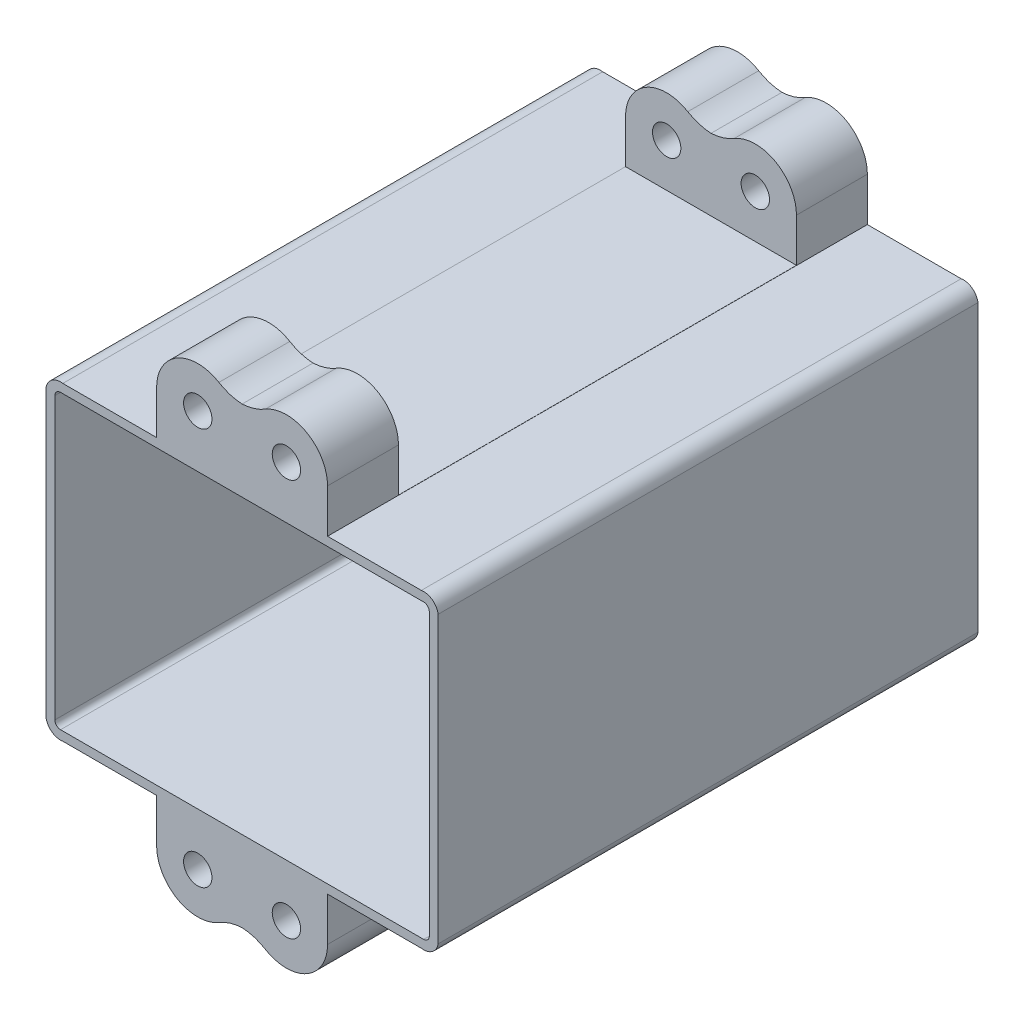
ISO-10303-21;
HEADER;
FILE_DESCRIPTION(('STEP AP214'),'2;1');
FILE_NAME('part.step','',(''),(''),'','','');
FILE_SCHEMA(('AUTOMOTIVE_DESIGN { 1 0 10303 214 1 1 1 1 }'));
ENDSEC;
DATA;
#1=APPLICATION_CONTEXT('core data for automotive mechanical design processes');
#2=APPLICATION_PROTOCOL_DEFINITION('international standard','automotive_design',2000,#1);
#3=PRODUCT_CONTEXT('',#1,'mechanical');
#4=PRODUCT('Part','Part','',(#3));
#5=PRODUCT_RELATED_PRODUCT_CATEGORY('part','',(#4));
#6=PRODUCT_DEFINITION_FORMATION('','',#4);
#7=PRODUCT_DEFINITION_CONTEXT('part definition',#1,'design');
#8=PRODUCT_DEFINITION('design','',#6,#7);
#9=PRODUCT_DEFINITION_SHAPE('','',#8);
#10=(LENGTH_UNIT() NAMED_UNIT(*) SI_UNIT(.MILLI.,.METRE.));
#11=(NAMED_UNIT(*) PLANE_ANGLE_UNIT() SI_UNIT($,.RADIAN.));
#12=(NAMED_UNIT(*) SI_UNIT($,.STERADIAN.) SOLID_ANGLE_UNIT());
#13=UNCERTAINTY_MEASURE_WITH_UNIT(LENGTH_MEASURE(1.E-05),#10,'distance_accuracy_value','');
#14=(GEOMETRIC_REPRESENTATION_CONTEXT(3) GLOBAL_UNCERTAINTY_ASSIGNED_CONTEXT((#13)) GLOBAL_UNIT_ASSIGNED_CONTEXT((#10,
#11,#12)) REPRESENTATION_CONTEXT('',''));
#15=CARTESIAN_POINT('',(0.,0.,0.));
#16=DIRECTION('',(0.,0.,1.));
#17=DIRECTION('',(1.,0.,0.));
#18=AXIS2_PLACEMENT_3D('',#15,#16,#17);
#19=CARTESIAN_POINT('',(-3.96875,-17.78,48.3362));
#20=DIRECTION('',(0.,0.,-1.));
#21=DIRECTION('',(-1.,0.,0.));
#22=AXIS2_PLACEMENT_3D('',#19,#20,#21);
#23=CYLINDRICAL_SURFACE('',#22,3.683);
#24=DIRECTION('',(0.,0.,-1.));
#25=VECTOR('',#24,1.);
#26=CARTESIAN_POINT('',(-2.07769603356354,-20.9404436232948,48.3362));
#27=LINE('',#26,#25);
#28=CARTESIAN_POINT('',(-2.07769603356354,-20.9404436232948,6.35000000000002));
#29=VERTEX_POINT('',#28);
#30=CARTESIAN_POINT('',(-2.07769603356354,-20.9404436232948,0.));
#31=VERTEX_POINT('',#30);
#32=EDGE_CURVE('E637',#29,#31,#27,.T.);
#33=ORIENTED_EDGE('',*,*,#32,.F.);
#34=CARTESIAN_POINT('',(-3.96875,-17.78,6.35000000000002));
#35=DIRECTION('',(0.,0.,-1.));
#36=DIRECTION('',(0.,1.,0.));
#37=AXIS2_PLACEMENT_3D('',#34,#35,#36);
#38=CIRCLE('',#37,3.683);
#39=CARTESIAN_POINT('',(-7.65175,-17.78,6.35000000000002));
#40=VERTEX_POINT('',#39);
#41=EDGE_CURVE('E689',#29,#40,#38,.T.);
#42=ORIENTED_EDGE('',*,*,#41,.T.);
#43=DIRECTION('',(0.,0.,-1.));
#44=VECTOR('',#43,1.);
#45=CARTESIAN_POINT('',(-7.65175,-17.78,48.3362));
#46=LINE('',#45,#44);
#47=CARTESIAN_POINT('',(-7.65175,-17.78,0.));
#48=VERTEX_POINT('',#47);
#49=EDGE_CURVE('E641',#40,#48,#46,.T.);
#50=ORIENTED_EDGE('',*,*,#49,.T.);
#51=CARTESIAN_POINT('',(-3.96875,-17.78,0.));
#52=DIRECTION('',(0.,0.,1.));
#53=DIRECTION('',(1.,0.,0.));
#54=AXIS2_PLACEMENT_3D('',#51,#52,#53);
#55=CIRCLE('',#54,3.683);
#56=EDGE_CURVE('E400',#48,#31,#55,.T.);
#57=ORIENTED_EDGE('',*,*,#56,.T.);
#58=EDGE_LOOP('',(#33,#42,#50,#57));
#59=FACE_BOUND('',#58,.T.);
#60=ADVANCED_FACE('F31',(#59),#23,.T.);
#61=CARTESIAN_POINT('',(0.2608350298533,-24.848738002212,48.3362));
#62=DIRECTION('',(0.,0.,-1.));
#63=DIRECTION('',(-1.,0.,0.));
#64=AXIS2_PLACEMENT_3D('',#61,#62,#63);
#65=CYLINDRICAL_SURFACE('',#64,4.5545024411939);
#66=DIRECTION('',(0.,0.,-1.));
#67=VECTOR('',#66,1.);
#68=CARTESIAN_POINT('',(0.,-20.301710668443,48.3362));
#69=LINE('',#68,#67);
#70=CARTESIAN_POINT('',(0.,-20.301710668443,6.35000000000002));
#71=VERTEX_POINT('',#70);
#72=CARTESIAN_POINT('',(0.,-20.301710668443,0.));
#73=VERTEX_POINT('',#72);
#74=EDGE_CURVE('E633',#71,#73,#69,.T.);
#75=ORIENTED_EDGE('',*,*,#74,.F.);
#76=CARTESIAN_POINT('',(0.2608350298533,-24.848738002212,6.35000000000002));
#77=DIRECTION('',(0.,0.,-1.));
#78=DIRECTION('',(0.,1.,0.));
#79=AXIS2_PLACEMENT_3D('',#76,#77,#78);
#80=CIRCLE('',#79,4.5545024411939);
#81=EDGE_CURVE('E686',#71,#29,#80,.F.);
#82=ORIENTED_EDGE('',*,*,#81,.T.);
#83=ORIENTED_EDGE('',*,*,#32,.T.);
#84=CARTESIAN_POINT('',(0.2608350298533,-24.848738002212,0.));
#85=DIRECTION('',(0.,0.,1.));
#86=DIRECTION('',(1.,0.,0.));
#87=AXIS2_PLACEMENT_3D('',#84,#85,#86);
#88=CIRCLE('',#87,4.5545024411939);
#89=EDGE_CURVE('E403',#31,#73,#88,.F.);
#90=ORIENTED_EDGE('',*,*,#89,.T.);
#91=EDGE_LOOP('',(#75,#82,#83,#90));
#92=FACE_BOUND('',#91,.T.);
#93=ADVANCED_FACE('F708',(#92),#65,.F.);
#94=CARTESIAN_POINT('',(-0.260835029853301,-24.848738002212,48.3362));
#95=DIRECTION('',(0.,0.,-1.));
#96=DIRECTION('',(-1.,0.,0.));
#97=AXIS2_PLACEMENT_3D('',#94,#95,#96);
#98=CYLINDRICAL_SURFACE('',#97,4.5545024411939);
#99=CARTESIAN_POINT('',(-0.260835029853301,-24.848738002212,6.35000000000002));
#100=DIRECTION('',(0.,0.,-1.));
#101=DIRECTION('',(0.,1.,0.));
#102=AXIS2_PLACEMENT_3D('',#99,#100,#101);
#103=CIRCLE('',#102,4.5545024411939);
#104=CARTESIAN_POINT('',(2.07769603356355,-20.9404436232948,6.35000000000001));
#105=VERTEX_POINT('',#104);
#106=EDGE_CURVE('E684',#71,#105,#103,.T.);
#107=ORIENTED_EDGE('',*,*,#106,.F.);
#108=ORIENTED_EDGE('',*,*,#74,.T.);
#109=CARTESIAN_POINT('',(-0.260835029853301,-24.848738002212,0.));
#110=DIRECTION('',(0.,0.,1.));
#111=DIRECTION('',(1.,0.,0.));
#112=AXIS2_PLACEMENT_3D('',#109,#110,#111);
#113=CIRCLE('',#112,4.5545024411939);
#114=CARTESIAN_POINT('',(2.07769603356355,-20.9404436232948,0.));
#115=VERTEX_POINT('',#114);
#116=EDGE_CURVE('E406',#115,#73,#113,.T.);
#117=ORIENTED_EDGE('',*,*,#116,.F.);
#118=DIRECTION('',(0.,0.,-1.));
#119=VECTOR('',#118,1.);
#120=CARTESIAN_POINT('',(2.07769603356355,-20.9404436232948,48.3362));
#121=LINE('',#120,#119);
#122=EDGE_CURVE('E629',#105,#115,#121,.T.);
#123=ORIENTED_EDGE('',*,*,#122,.F.);
#124=EDGE_LOOP('',(#107,#108,#117,#123));
#125=FACE_BOUND('',#124,.T.);
#126=ADVANCED_FACE('F713',(#125),#98,.F.);
#127=CARTESIAN_POINT('',(3.96875,-17.78,48.3362));
#128=DIRECTION('',(0.,0.,-1.));
#129=DIRECTION('',(-1.,0.,0.));
#130=AXIS2_PLACEMENT_3D('',#127,#128,#129);
#131=CYLINDRICAL_SURFACE('',#130,3.683);
#132=CARTESIAN_POINT('',(3.96875,-17.78,6.35000000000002));
#133=DIRECTION('',(0.,0.,-1.));
#134=DIRECTION('',(0.,1.,0.));
#135=AXIS2_PLACEMENT_3D('',#132,#133,#134);
#136=CIRCLE('',#135,3.683);
#137=CARTESIAN_POINT('',(7.65175,-17.78,6.35000000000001));
#138=VERTEX_POINT('',#137);
#139=EDGE_CURVE('E682',#105,#138,#136,.F.);
#140=ORIENTED_EDGE('',*,*,#139,.F.);
#141=ORIENTED_EDGE('',*,*,#122,.T.);
#142=CARTESIAN_POINT('',(3.96875,-17.78,0.));
#143=DIRECTION('',(0.,0.,1.));
#144=DIRECTION('',(1.,0.,0.));
#145=AXIS2_PLACEMENT_3D('',#142,#143,#144);
#146=CIRCLE('',#145,3.683);
#147=CARTESIAN_POINT('',(7.65175,-17.78,0.));
#148=VERTEX_POINT('',#147);
#149=EDGE_CURVE('E409',#148,#115,#146,.F.);
#150=ORIENTED_EDGE('',*,*,#149,.F.);
#151=DIRECTION('',(0.,0.,-1.));
#152=VECTOR('',#151,1.);
#153=CARTESIAN_POINT('',(7.65175,-17.78,48.3362));
#154=LINE('',#153,#152);
#155=EDGE_CURVE('E625',#138,#148,#154,.T.);
#156=ORIENTED_EDGE('',*,*,#155,.F.);
#157=EDGE_LOOP('',(#140,#141,#150,#156));
#158=FACE_BOUND('',#157,.T.);
#159=ADVANCED_FACE('F716',(#158),#131,.T.);
#160=CARTESIAN_POINT('',(3.96875,-17.78,48.3362));
#161=DIRECTION('',(0.,0.,-1.));
#162=DIRECTION('',(-1.,0.,0.));
#163=AXIS2_PLACEMENT_3D('',#160,#161,#162);
#164=CYLINDRICAL_SURFACE('',#163,1.27);
#165=CARTESIAN_POINT('',(3.96875,-17.78,6.35000000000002));
#166=DIRECTION('',(0.,0.,-1.));
#167=DIRECTION('',(0.,1.,0.));
#168=AXIS2_PLACEMENT_3D('',#165,#166,#167);
#169=CIRCLE('',#168,1.27);
#170=CARTESIAN_POINT('',(2.69875,-17.78,6.35000000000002));
#171=VERTEX_POINT('',#170);
#172=EDGE_CURVE('E676',#171,#171,#169,.T.);
#173=CARTESIAN_POINT('',(3.96875,-17.78,0.));
#174=DIRECTION('',(0.,0.,1.));
#175=DIRECTION('',(1.,0.,0.));
#176=AXIS2_PLACEMENT_3D('',#173,#174,#175);
#177=CIRCLE('',#176,1.27);
#178=CARTESIAN_POINT('',(2.69875,-17.78,0.));
#179=VERTEX_POINT('',#178);
#180=EDGE_CURVE('E452',#179,#179,#177,.T.);
#181=CARTESIAN_POINT('',(2.69875,-17.78,6.35000000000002));
#182=CARTESIAN_POINT('',(2.69875,-17.78,6.28385416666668));
#183=CARTESIAN_POINT('',(2.69875,-17.78,6.21770833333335));
#184=CARTESIAN_POINT('',(2.69875,-17.78,6.08541666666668));
#185=CARTESIAN_POINT('',(2.69875,-17.78,6.01927083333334));
#186=CARTESIAN_POINT('',(2.69875,-17.78,5.88697916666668));
#187=CARTESIAN_POINT('',(2.69875,-17.78,5.82083333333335));
#188=CARTESIAN_POINT('',(2.69875,-17.78,5.68854166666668));
#189=CARTESIAN_POINT('',(2.69875,-17.78,5.62239583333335));
#190=CARTESIAN_POINT('',(2.69875,-17.78,5.49010416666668));
#191=CARTESIAN_POINT('',(2.69875,-17.78,5.42395833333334));
#192=CARTESIAN_POINT('',(2.69875,-17.78,5.29166666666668));
#193=CARTESIAN_POINT('',(2.69875,-17.78,5.22552083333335));
#194=CARTESIAN_POINT('',(2.69875,-17.78,5.09322916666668));
#195=CARTESIAN_POINT('',(2.69875,-17.78,5.02708333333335));
#196=CARTESIAN_POINT('',(2.69875,-17.78,4.89479166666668));
#197=CARTESIAN_POINT('',(2.69875,-17.78,4.82864583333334));
#198=CARTESIAN_POINT('',(2.69875,-17.78,4.69635416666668));
#199=CARTESIAN_POINT('',(2.69875,-17.78,4.63020833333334));
#200=CARTESIAN_POINT('',(2.69875,-17.78,4.49791666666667));
#201=CARTESIAN_POINT('',(2.69875,-17.78,4.43177083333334));
#202=CARTESIAN_POINT('',(2.69875,-17.78,4.29947916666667));
#203=CARTESIAN_POINT('',(2.69875,-17.78,4.23333333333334));
#204=CARTESIAN_POINT('',(2.69875,-17.78,4.10104166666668));
#205=CARTESIAN_POINT('',(2.69875,-17.78,4.03489583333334));
#206=CARTESIAN_POINT('',(2.69875,-17.78,3.90260416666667));
#207=CARTESIAN_POINT('',(2.69875,-17.78,3.83645833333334));
#208=CARTESIAN_POINT('',(2.69875,-17.78,3.70416666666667));
#209=CARTESIAN_POINT('',(2.69875,-17.78,3.63802083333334));
#210=CARTESIAN_POINT('',(2.69875,-17.78,3.50572916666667));
#211=CARTESIAN_POINT('',(2.69875,-17.78,3.43958333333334));
#212=CARTESIAN_POINT('',(2.69875,-17.78,3.30729166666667));
#213=CARTESIAN_POINT('',(2.69875,-17.78,3.24114583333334));
#214=CARTESIAN_POINT('',(2.69875,-17.78,3.10885416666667));
#215=CARTESIAN_POINT('',(2.69875,-17.78,3.04270833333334));
#216=CARTESIAN_POINT('',(2.69875,-17.78,2.91041666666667));
#217=CARTESIAN_POINT('',(2.69875,-17.78,2.84427083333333));
#218=CARTESIAN_POINT('',(2.69875,-17.78,2.71197916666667));
#219=CARTESIAN_POINT('',(2.69875,-17.78,2.64583333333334));
#220=CARTESIAN_POINT('',(2.69875,-17.78,2.51354166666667));
#221=CARTESIAN_POINT('',(2.69875,-17.78,2.44739583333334));
#222=CARTESIAN_POINT('',(2.69875,-17.78,2.31510416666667));
#223=CARTESIAN_POINT('',(2.69875,-17.78,2.24895833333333));
#224=CARTESIAN_POINT('',(2.69875,-17.78,2.11666666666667));
#225=CARTESIAN_POINT('',(2.69875,-17.78,2.05052083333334));
#226=CARTESIAN_POINT('',(2.69875,-17.78,1.91822916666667));
#227=CARTESIAN_POINT('',(2.69875,-17.78,1.85208333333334));
#228=CARTESIAN_POINT('',(2.69875,-17.78,1.71979166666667));
#229=CARTESIAN_POINT('',(2.69875,-17.78,1.65364583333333));
#230=CARTESIAN_POINT('',(2.69875,-17.78,1.52135416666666));
#231=CARTESIAN_POINT('',(2.69875,-17.78,1.45520833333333));
#232=CARTESIAN_POINT('',(2.69875,-17.78,1.32291666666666));
#233=CARTESIAN_POINT('',(2.69875,-17.78,1.25677083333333));
#234=CARTESIAN_POINT('',(2.69875,-17.78,1.12447916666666));
#235=CARTESIAN_POINT('',(2.69875,-17.78,1.05833333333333));
#236=CARTESIAN_POINT('',(2.69875,-17.78,0.926041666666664));
#237=CARTESIAN_POINT('',(2.69875,-17.78,0.85989583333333));
#238=CARTESIAN_POINT('',(2.69875,-17.78,0.727604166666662));
#239=CARTESIAN_POINT('',(2.69875,-17.78,0.661458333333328));
#240=CARTESIAN_POINT('',(2.69875,-17.78,0.529166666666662));
#241=CARTESIAN_POINT('',(2.69875,-17.78,0.46302083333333));
#242=CARTESIAN_POINT('',(2.69875,-17.78,0.330729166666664));
#243=CARTESIAN_POINT('',(2.69875,-17.78,0.26458333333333));
#244=CARTESIAN_POINT('',(2.69875,-17.78,0.132291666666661));
#245=CARTESIAN_POINT('',(2.69875,-17.78,0.0661458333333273));
#246=CARTESIAN_POINT('',(2.69875,-17.78,0.));
#247=B_SPLINE_CURVE_WITH_KNOTS('',3,(#181,#182,#183,#184,#185,#186,#187,#188,#189,#190,#191,
#192,#193,#194,#195,#196,#197,#198,#199,#200,#201,#202,#203,#204,#205,#206,#207,#208,#209,#210,
#211,#212,#213,#214,#215,#216,#217,#218,#219,#220,#221,#222,#223,#224,#225,#226,#227,#228,#229,
#230,#231,#232,#233,#234,#235,#236,#237,#238,#239,#240,#241,#242,#243,#244,#245,#246),
.UNSPECIFIED.,.F.,.F.,(4,2,2,2,2,2,2,2,2,2,2,2,2,2,2,2,2,2,2,2,2,2,2,2,2,2,2,2,2,2,2,2,4),(0.,
0.198437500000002,0.396875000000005,0.5953125,0.793750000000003,0.992187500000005,1.190625,
1.3890625,1.58750000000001,1.78593750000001,1.98437500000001,2.18281250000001,2.38125000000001,
2.57968750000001,2.77812500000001,2.97656250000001,3.17500000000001,3.37343750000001,
3.57187500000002,3.77031250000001,3.96875000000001,4.16718750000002,4.36562500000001,
4.56406250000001,4.76250000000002,4.96093750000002,5.15937500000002,5.35781250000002,
5.55625000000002,5.75468750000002,5.95312500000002,6.15156250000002,6.35000000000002),.UNSPECIFIED.);
#248=EDGE_CURVE('BSEAM924',#171,#179,#247,.T.);
#249=ORIENTED_EDGE('',*,*,#172,.F.);
#250=ORIENTED_EDGE('',*,*,#180,.F.);
#251=ORIENTED_EDGE('',*,*,#248,.T.);
#252=ORIENTED_EDGE('',*,*,#248,.F.);
#253=EDGE_LOOP('',(#249,#251,#250,#252));
#254=FACE_BOUND('',#253,.T.);
#255=ADVANCED_FACE('F924',(#254),#164,.F.);
#256=CARTESIAN_POINT('',(-3.96875,-17.78,48.3362));
#257=DIRECTION('',(0.,0.,-1.));
#258=DIRECTION('',(-1.,0.,0.));
#259=AXIS2_PLACEMENT_3D('',#256,#257,#258);
#260=CYLINDRICAL_SURFACE('',#259,1.27);
#261=CARTESIAN_POINT('',(-3.96875,-17.78,6.35000000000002));
#262=DIRECTION('',(0.,0.,-1.));
#263=DIRECTION('',(0.,1.,0.));
#264=AXIS2_PLACEMENT_3D('',#261,#262,#263);
#265=CIRCLE('',#264,1.27);
#266=CARTESIAN_POINT('',(-5.23875,-17.78,6.35000000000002));
#267=VERTEX_POINT('',#266);
#268=EDGE_CURVE('E35',#267,#267,#265,.F.);
#269=CARTESIAN_POINT('',(-3.96875,-17.78,0.));
#270=DIRECTION('',(0.,0.,1.));
#271=DIRECTION('',(1.,0.,0.));
#272=AXIS2_PLACEMENT_3D('',#269,#270,#271);
#273=CIRCLE('',#272,1.27);
#274=CARTESIAN_POINT('',(-5.23875,-17.78,0.));
#275=VERTEX_POINT('',#274);
#276=EDGE_CURVE('E446',#275,#275,#273,.F.);
#277=CARTESIAN_POINT('',(-5.23875,-17.78,6.35000000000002));
#278=CARTESIAN_POINT('',(-5.23875,-17.78,6.28385416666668));
#279=CARTESIAN_POINT('',(-5.23875,-17.78,6.21770833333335));
#280=CARTESIAN_POINT('',(-5.23875,-17.78,6.08541666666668));
#281=CARTESIAN_POINT('',(-5.23875,-17.78,6.01927083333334));
#282=CARTESIAN_POINT('',(-5.23875,-17.78,5.88697916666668));
#283=CARTESIAN_POINT('',(-5.23875,-17.78,5.82083333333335));
#284=CARTESIAN_POINT('',(-5.23875,-17.78,5.68854166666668));
#285=CARTESIAN_POINT('',(-5.23875,-17.78,5.62239583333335));
#286=CARTESIAN_POINT('',(-5.23875,-17.78,5.49010416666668));
#287=CARTESIAN_POINT('',(-5.23875,-17.78,5.42395833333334));
#288=CARTESIAN_POINT('',(-5.23875,-17.78,5.29166666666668));
#289=CARTESIAN_POINT('',(-5.23875,-17.78,5.22552083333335));
#290=CARTESIAN_POINT('',(-5.23875,-17.78,5.09322916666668));
#291=CARTESIAN_POINT('',(-5.23875,-17.78,5.02708333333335));
#292=CARTESIAN_POINT('',(-5.23875,-17.78,4.89479166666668));
#293=CARTESIAN_POINT('',(-5.23875,-17.78,4.82864583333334));
#294=CARTESIAN_POINT('',(-5.23875,-17.78,4.69635416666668));
#295=CARTESIAN_POINT('',(-5.23875,-17.78,4.63020833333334));
#296=CARTESIAN_POINT('',(-5.23875,-17.78,4.49791666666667));
#297=CARTESIAN_POINT('',(-5.23875,-17.78,4.43177083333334));
#298=CARTESIAN_POINT('',(-5.23875,-17.78,4.29947916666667));
#299=CARTESIAN_POINT('',(-5.23875,-17.78,4.23333333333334));
#300=CARTESIAN_POINT('',(-5.23875,-17.78,4.10104166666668));
#301=CARTESIAN_POINT('',(-5.23875,-17.78,4.03489583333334));
#302=CARTESIAN_POINT('',(-5.23875,-17.78,3.90260416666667));
#303=CARTESIAN_POINT('',(-5.23875,-17.78,3.83645833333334));
#304=CARTESIAN_POINT('',(-5.23875,-17.78,3.70416666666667));
#305=CARTESIAN_POINT('',(-5.23875,-17.78,3.63802083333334));
#306=CARTESIAN_POINT('',(-5.23875,-17.78,3.50572916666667));
#307=CARTESIAN_POINT('',(-5.23875,-17.78,3.43958333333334));
#308=CARTESIAN_POINT('',(-5.23875,-17.78,3.30729166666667));
#309=CARTESIAN_POINT('',(-5.23875,-17.78,3.24114583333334));
#310=CARTESIAN_POINT('',(-5.23875,-17.78,3.10885416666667));
#311=CARTESIAN_POINT('',(-5.23875,-17.78,3.04270833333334));
#312=CARTESIAN_POINT('',(-5.23875,-17.78,2.91041666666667));
#313=CARTESIAN_POINT('',(-5.23875,-17.78,2.84427083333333));
#314=CARTESIAN_POINT('',(-5.23875,-17.78,2.71197916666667));
#315=CARTESIAN_POINT('',(-5.23875,-17.78,2.64583333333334));
#316=CARTESIAN_POINT('',(-5.23875,-17.78,2.51354166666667));
#317=CARTESIAN_POINT('',(-5.23875,-17.78,2.44739583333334));
#318=CARTESIAN_POINT('',(-5.23875,-17.78,2.31510416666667));
#319=CARTESIAN_POINT('',(-5.23875,-17.78,2.24895833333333));
#320=CARTESIAN_POINT('',(-5.23875,-17.78,2.11666666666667));
#321=CARTESIAN_POINT('',(-5.23875,-17.78,2.05052083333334));
#322=CARTESIAN_POINT('',(-5.23875,-17.78,1.91822916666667));
#323=CARTESIAN_POINT('',(-5.23875,-17.78,1.85208333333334));
#324=CARTESIAN_POINT('',(-5.23875,-17.78,1.71979166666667));
#325=CARTESIAN_POINT('',(-5.23875,-17.78,1.65364583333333));
#326=CARTESIAN_POINT('',(-5.23875,-17.78,1.52135416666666));
#327=CARTESIAN_POINT('',(-5.23875,-17.78,1.45520833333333));
#328=CARTESIAN_POINT('',(-5.23875,-17.78,1.32291666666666));
#329=CARTESIAN_POINT('',(-5.23875,-17.78,1.25677083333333));
#330=CARTESIAN_POINT('',(-5.23875,-17.78,1.12447916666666));
#331=CARTESIAN_POINT('',(-5.23875,-17.78,1.05833333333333));
#332=CARTESIAN_POINT('',(-5.23875,-17.78,0.926041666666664));
#333=CARTESIAN_POINT('',(-5.23875,-17.78,0.85989583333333));
#334=CARTESIAN_POINT('',(-5.23875,-17.78,0.727604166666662));
#335=CARTESIAN_POINT('',(-5.23875,-17.78,0.661458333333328));
#336=CARTESIAN_POINT('',(-5.23875,-17.78,0.529166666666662));
#337=CARTESIAN_POINT('',(-5.23875,-17.78,0.46302083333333));
#338=CARTESIAN_POINT('',(-5.23875,-17.78,0.330729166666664));
#339=CARTESIAN_POINT('',(-5.23875,-17.78,0.26458333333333));
#340=CARTESIAN_POINT('',(-5.23875,-17.78,0.132291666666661));
#341=CARTESIAN_POINT('',(-5.23875,-17.78,0.0661458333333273));
#342=CARTESIAN_POINT('',(-5.23875,-17.78,0.));
#343=B_SPLINE_CURVE_WITH_KNOTS('',3,(#277,#278,#279,#280,#281,#282,#283,#284,#285,#286,#287,
#288,#289,#290,#291,#292,#293,#294,#295,#296,#297,#298,#299,#300,#301,#302,#303,#304,#305,#306,
#307,#308,#309,#310,#311,#312,#313,#314,#315,#316,#317,#318,#319,#320,#321,#322,#323,#324,#325,
#326,#327,#328,#329,#330,#331,#332,#333,#334,#335,#336,#337,#338,#339,#340,#341,#342),
.UNSPECIFIED.,.F.,.F.,(4,2,2,2,2,2,2,2,2,2,2,2,2,2,2,2,2,2,2,2,2,2,2,2,2,2,2,2,2,2,2,2,4),(0.,
0.198437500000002,0.396875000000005,0.5953125,0.793750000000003,0.992187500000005,1.190625,
1.3890625,1.58750000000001,1.78593750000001,1.98437500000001,2.18281250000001,2.38125000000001,
2.57968750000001,2.77812500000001,2.97656250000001,3.17500000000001,3.37343750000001,
3.57187500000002,3.77031250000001,3.96875000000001,4.16718750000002,4.36562500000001,
4.56406250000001,4.76250000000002,4.96093750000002,5.15937500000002,5.35781250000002,
5.55625000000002,5.75468750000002,5.95312500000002,6.15156250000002,6.35000000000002),.UNSPECIFIED.);
#344=EDGE_CURVE('BSEAM932',#267,#275,#343,.T.);
#345=ORIENTED_EDGE('',*,*,#268,.T.);
#346=ORIENTED_EDGE('',*,*,#276,.T.);
#347=ORIENTED_EDGE('',*,*,#344,.T.);
#348=ORIENTED_EDGE('',*,*,#344,.F.);
#349=EDGE_LOOP('',(#345,#347,#346,#348));
#350=FACE_BOUND('',#349,.T.);
#351=ADVANCED_FACE('F932',(#350),#260,.F.);
#352=CARTESIAN_POINT('',(3.96875,17.78,48.3362));
#353=DIRECTION('',(0.,0.,-1.));
#354=DIRECTION('',(-1.,0.,0.));
#355=AXIS2_PLACEMENT_3D('',#352,#353,#354);
#356=CYLINDRICAL_SURFACE('',#355,3.683);
#357=DIRECTION('',(0.,0.,-1.));
#358=VECTOR('',#357,1.);
#359=CARTESIAN_POINT('',(7.65175,17.78,48.3362));
#360=LINE('',#359,#358);
#361=CARTESIAN_POINT('',(7.65175,17.78,48.3362));
#362=VERTEX_POINT('',#361);
#363=CARTESIAN_POINT('',(7.65175,17.78,41.9862));
#364=VERTEX_POINT('',#363);
#365=EDGE_CURVE('E608',#362,#364,#360,.T.);
#366=ORIENTED_EDGE('',*,*,#365,.T.);
#367=CARTESIAN_POINT('',(3.96875,17.78,41.9862));
#368=DIRECTION('',(0.,0.,1.));
#369=DIRECTION('',(1.,0.,0.));
#370=AXIS2_PLACEMENT_3D('',#367,#368,#369);
#371=CIRCLE('',#370,3.683);
#372=CARTESIAN_POINT('',(2.07769603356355,20.9404436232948,41.9862));
#373=VERTEX_POINT('',#372);
#374=EDGE_CURVE('E373',#364,#373,#371,.T.);
#375=ORIENTED_EDGE('',*,*,#374,.T.);
#376=DIRECTION('',(0.,0.,-1.));
#377=VECTOR('',#376,1.);
#378=CARTESIAN_POINT('',(2.07769603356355,20.9404436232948,48.3362));
#379=LINE('',#378,#377);
#380=CARTESIAN_POINT('',(2.07769603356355,20.9404436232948,48.3362));
#381=VERTEX_POINT('',#380);
#382=EDGE_CURVE('E604',#381,#373,#379,.T.);
#383=ORIENTED_EDGE('',*,*,#382,.F.);
#384=CARTESIAN_POINT('',(3.96875,17.78,48.3362));
#385=DIRECTION('',(0.,0.,1.));
#386=DIRECTION('',(1.,0.,0.));
#387=AXIS2_PLACEMENT_3D('',#384,#385,#386);
#388=CIRCLE('',#387,3.683);
#389=EDGE_CURVE('E525',#362,#381,#388,.T.);
#390=ORIENTED_EDGE('',*,*,#389,.F.);
#391=EDGE_LOOP('',(#366,#375,#383,#390));
#392=FACE_BOUND('',#391,.T.);
#393=ADVANCED_FACE('F820',(#392),#356,.T.);
#394=CARTESIAN_POINT('',(-0.260835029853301,24.848738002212,48.3362));
#395=DIRECTION('',(0.,0.,-1.));
#396=DIRECTION('',(-1.,0.,0.));
#397=AXIS2_PLACEMENT_3D('',#394,#395,#396);
#398=CYLINDRICAL_SURFACE('',#397,4.5545024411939);
#399=ORIENTED_EDGE('',*,*,#382,.T.);
#400=CARTESIAN_POINT('',(-0.260835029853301,24.848738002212,41.9862));
#401=DIRECTION('',(0.,0.,1.));
#402=DIRECTION('',(1.,0.,0.));
#403=AXIS2_PLACEMENT_3D('',#400,#401,#402);
#404=CIRCLE('',#403,4.5545024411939);
#405=CARTESIAN_POINT('',(0.,20.301710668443,41.9862));
#406=VERTEX_POINT('',#405);
#407=EDGE_CURVE('E370',#373,#406,#404,.F.);
#408=ORIENTED_EDGE('',*,*,#407,.T.);
#409=DIRECTION('',(0.,0.,-1.));
#410=VECTOR('',#409,1.);
#411=CARTESIAN_POINT('',(0.,20.301710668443,48.3362));
#412=LINE('',#411,#410);
#413=CARTESIAN_POINT('',(0.,20.301710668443,48.3362));
#414=VERTEX_POINT('',#413);
#415=EDGE_CURVE('E600',#414,#406,#412,.T.);
#416=ORIENTED_EDGE('',*,*,#415,.F.);
#417=CARTESIAN_POINT('',(-0.260835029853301,24.848738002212,48.3362));
#418=DIRECTION('',(0.,0.,1.));
#419=DIRECTION('',(1.,0.,0.));
#420=AXIS2_PLACEMENT_3D('',#417,#418,#419);
#421=CIRCLE('',#420,4.5545024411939);
#422=EDGE_CURVE('E527',#381,#414,#421,.F.);
#423=ORIENTED_EDGE('',*,*,#422,.F.);
#424=EDGE_LOOP('',(#399,#408,#416,#423));
#425=FACE_BOUND('',#424,.T.);
#426=ADVANCED_FACE('F822',(#425),#398,.F.);
#427=CARTESIAN_POINT('',(0.2608350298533,24.848738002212,48.3362));
#428=DIRECTION('',(0.,0.,-1.));
#429=DIRECTION('',(-1.,0.,0.));
#430=AXIS2_PLACEMENT_3D('',#427,#428,#429);
#431=CYLINDRICAL_SURFACE('',#430,4.5545024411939);
#432=CARTESIAN_POINT('',(0.2608350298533,24.848738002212,41.9862));
#433=DIRECTION('',(0.,0.,1.));
#434=DIRECTION('',(1.,0.,0.));
#435=AXIS2_PLACEMENT_3D('',#432,#433,#434);
#436=CIRCLE('',#435,4.5545024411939);
#437=CARTESIAN_POINT('',(-2.07769603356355,20.9404436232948,41.9862));
#438=VERTEX_POINT('',#437);
#439=EDGE_CURVE('E368',#438,#406,#436,.T.);
#440=ORIENTED_EDGE('',*,*,#439,.F.);
#441=DIRECTION('',(0.,0.,-1.));
#442=VECTOR('',#441,1.);
#443=CARTESIAN_POINT('',(-2.07769603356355,20.9404436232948,48.3362));
#444=LINE('',#443,#442);
#445=CARTESIAN_POINT('',(-2.07769603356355,20.9404436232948,48.3362));
#446=VERTEX_POINT('',#445);
#447=EDGE_CURVE('E596',#446,#438,#444,.T.);
#448=ORIENTED_EDGE('',*,*,#447,.F.);
#449=CARTESIAN_POINT('',(0.2608350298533,24.848738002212,48.3362));
#450=DIRECTION('',(0.,0.,1.));
#451=DIRECTION('',(1.,0.,0.));
#452=AXIS2_PLACEMENT_3D('',#449,#450,#451);
#453=CIRCLE('',#452,4.5545024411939);
#454=EDGE_CURVE('E529',#446,#414,#453,.T.);
#455=ORIENTED_EDGE('',*,*,#454,.T.);
#456=ORIENTED_EDGE('',*,*,#415,.T.);
#457=EDGE_LOOP('',(#440,#448,#455,#456));
#458=FACE_BOUND('',#457,.T.);
#459=ADVANCED_FACE('F825',(#458),#431,.F.);
#460=CARTESIAN_POINT('',(-3.96875,17.78,48.3362));
#461=DIRECTION('',(0.,0.,-1.));
#462=DIRECTION('',(-1.,0.,0.));
#463=AXIS2_PLACEMENT_3D('',#460,#461,#462);
#464=CYLINDRICAL_SURFACE('',#463,3.683);
#465=CARTESIAN_POINT('',(-3.96875,17.78,41.9862));
#466=DIRECTION('',(0.,0.,1.));
#467=DIRECTION('',(1.,0.,0.));
#468=AXIS2_PLACEMENT_3D('',#465,#466,#467);
#469=CIRCLE('',#468,3.683);
#470=CARTESIAN_POINT('',(-7.65175,17.78,41.9862));
#471=VERTEX_POINT('',#470);
#472=EDGE_CURVE('E366',#471,#438,#469,.F.);
#473=ORIENTED_EDGE('',*,*,#472,.F.);
#474=DIRECTION('',(0.,0.,-1.));
#475=VECTOR('',#474,1.);
#476=CARTESIAN_POINT('',(-7.65175,17.78,48.3362));
#477=LINE('',#476,#475);
#478=CARTESIAN_POINT('',(-7.65175,17.78,48.3362));
#479=VERTEX_POINT('',#478);
#480=EDGE_CURVE('E592',#479,#471,#477,.T.);
#481=ORIENTED_EDGE('',*,*,#480,.F.);
#482=CARTESIAN_POINT('',(-3.96875,17.78,48.3362));
#483=DIRECTION('',(0.,0.,1.));
#484=DIRECTION('',(1.,0.,0.));
#485=AXIS2_PLACEMENT_3D('',#482,#483,#484);
#486=CIRCLE('',#485,3.683);
#487=EDGE_CURVE('E532',#479,#446,#486,.F.);
#488=ORIENTED_EDGE('',*,*,#487,.T.);
#489=ORIENTED_EDGE('',*,*,#447,.T.);
#490=EDGE_LOOP('',(#473,#481,#488,#489));
#491=FACE_BOUND('',#490,.T.);
#492=ADVANCED_FACE('F829',(#491),#464,.T.);
#493=CARTESIAN_POINT('',(-3.96875,17.78,48.3362));
#494=DIRECTION('',(0.,0.,-1.));
#495=DIRECTION('',(-1.,0.,0.));
#496=AXIS2_PLACEMENT_3D('',#493,#494,#495);
#497=CYLINDRICAL_SURFACE('',#496,1.27);
#498=CARTESIAN_POINT('',(-3.96875,17.78,41.9862));
#499=DIRECTION('',(0.,0.,1.));
#500=DIRECTION('',(1.,0.,0.));
#501=AXIS2_PLACEMENT_3D('',#498,#499,#500);
#502=CIRCLE('',#501,1.27);
#503=CARTESIAN_POINT('',(-5.23875,17.78,41.9862));
#504=VERTEX_POINT('',#503);
#505=EDGE_CURVE('E378',#504,#504,#502,.T.);
#506=CARTESIAN_POINT('',(-3.96875,17.78,48.3362));
#507=DIRECTION('',(0.,0.,1.));
#508=DIRECTION('',(1.,0.,0.));
#509=AXIS2_PLACEMENT_3D('',#506,#507,#508);
#510=CIRCLE('',#509,1.27);
#511=CARTESIAN_POINT('',(-5.23875,17.78,48.3362));
#512=VERTEX_POINT('',#511);
#513=EDGE_CURVE('E540',#512,#512,#510,.T.);
#514=CARTESIAN_POINT('',(-5.23875,17.78,41.9862));
#515=CARTESIAN_POINT('',(-5.23875,17.78,42.0523458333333));
#516=CARTESIAN_POINT('',(-5.23875,17.78,42.1184916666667));
#517=CARTESIAN_POINT('',(-5.23875,17.78,42.2507833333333));
#518=CARTESIAN_POINT('',(-5.23875,17.78,42.3169291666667));
#519=CARTESIAN_POINT('',(-5.23875,17.78,42.4492208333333));
#520=CARTESIAN_POINT('',(-5.23875,17.78,42.5153666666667));
#521=CARTESIAN_POINT('',(-5.23875,17.78,42.6476583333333));
#522=CARTESIAN_POINT('',(-5.23875,17.78,42.7138041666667));
#523=CARTESIAN_POINT('',(-5.23875,17.78,42.8460958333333));
#524=CARTESIAN_POINT('',(-5.23875,17.78,42.9122416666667));
#525=CARTESIAN_POINT('',(-5.23875,17.78,43.0445333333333));
#526=CARTESIAN_POINT('',(-5.23875,17.78,43.1106791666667));
#527=CARTESIAN_POINT('',(-5.23875,17.78,43.2429708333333));
#528=CARTESIAN_POINT('',(-5.23875,17.78,43.3091166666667));
#529=CARTESIAN_POINT('',(-5.23875,17.78,43.4414083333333));
#530=CARTESIAN_POINT('',(-5.23875,17.78,43.5075541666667));
#531=CARTESIAN_POINT('',(-5.23875,17.78,43.6398458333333));
#532=CARTESIAN_POINT('',(-5.23875,17.78,43.7059916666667));
#533=CARTESIAN_POINT('',(-5.23875,17.78,43.8382833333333));
#534=CARTESIAN_POINT('',(-5.23875,17.78,43.9044291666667));
#535=CARTESIAN_POINT('',(-5.23875,17.78,44.0367208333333));
#536=CARTESIAN_POINT('',(-5.23875,17.78,44.1028666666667));
#537=CARTESIAN_POINT('',(-5.23875,17.78,44.2351583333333));
#538=CARTESIAN_POINT('',(-5.23875,17.78,44.3013041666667));
#539=CARTESIAN_POINT('',(-5.23875,17.78,44.4335958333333));
#540=CARTESIAN_POINT('',(-5.23875,17.78,44.4997416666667));
#541=CARTESIAN_POINT('',(-5.23875,17.78,44.6320333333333));
#542=CARTESIAN_POINT('',(-5.23875,17.78,44.6981791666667));
#543=CARTESIAN_POINT('',(-5.23875,17.78,44.8304708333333));
#544=CARTESIAN_POINT('',(-5.23875,17.78,44.8966166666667));
#545=CARTESIAN_POINT('',(-5.23875,17.78,45.0289083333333));
#546=CARTESIAN_POINT('',(-5.23875,17.78,45.0950541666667));
#547=CARTESIAN_POINT('',(-5.23875,17.78,45.2273458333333));
#548=CARTESIAN_POINT('',(-5.23875,17.78,45.2934916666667));
#549=CARTESIAN_POINT('',(-5.23875,17.78,45.4257833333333));
#550=CARTESIAN_POINT('',(-5.23875,17.78,45.4919291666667));
#551=CARTESIAN_POINT('',(-5.23875,17.78,45.6242208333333));
#552=CARTESIAN_POINT('',(-5.23875,17.78,45.6903666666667));
#553=CARTESIAN_POINT('',(-5.23875,17.78,45.8226583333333));
#554=CARTESIAN_POINT('',(-5.23875,17.78,45.8888041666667));
#555=CARTESIAN_POINT('',(-5.23875,17.78,46.0210958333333));
#556=CARTESIAN_POINT('',(-5.23875,17.78,46.0872416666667));
#557=CARTESIAN_POINT('',(-5.23875,17.78,46.2195333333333));
#558=CARTESIAN_POINT('',(-5.23875,17.78,46.2856791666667));
#559=CARTESIAN_POINT('',(-5.23875,17.78,46.4179708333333));
#560=CARTESIAN_POINT('',(-5.23875,17.78,46.4841166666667));
#561=CARTESIAN_POINT('',(-5.23875,17.78,46.6164083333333));
#562=CARTESIAN_POINT('',(-5.23875,17.78,46.6825541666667));
#563=CARTESIAN_POINT('',(-5.23875,17.78,46.8148458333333));
#564=CARTESIAN_POINT('',(-5.23875,17.78,46.8809916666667));
#565=CARTESIAN_POINT('',(-5.23875,17.78,47.0132833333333));
#566=CARTESIAN_POINT('',(-5.23875,17.78,47.0794291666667));
#567=CARTESIAN_POINT('',(-5.23875,17.78,47.2117208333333));
#568=CARTESIAN_POINT('',(-5.23875,17.78,47.2778666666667));
#569=CARTESIAN_POINT('',(-5.23875,17.78,47.4101583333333));
#570=CARTESIAN_POINT('',(-5.23875,17.78,47.4763041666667));
#571=CARTESIAN_POINT('',(-5.23875,17.78,47.6085958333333));
#572=CARTESIAN_POINT('',(-5.23875,17.78,47.6747416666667));
#573=CARTESIAN_POINT('',(-5.23875,17.78,47.8070333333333));
#574=CARTESIAN_POINT('',(-5.23875,17.78,47.8731791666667));
#575=CARTESIAN_POINT('',(-5.23875,17.78,48.0054708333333));
#576=CARTESIAN_POINT('',(-5.23875,17.78,48.0716166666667));
#577=CARTESIAN_POINT('',(-5.23875,17.78,48.2039083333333));
#578=CARTESIAN_POINT('',(-5.23875,17.78,48.2700541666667));
#579=CARTESIAN_POINT('',(-5.23875,17.78,48.3362));
#580=B_SPLINE_CURVE_WITH_KNOTS('',3,(#514,#515,#516,#517,#518,#519,#520,#521,#522,#523,#524,
#525,#526,#527,#528,#529,#530,#531,#532,#533,#534,#535,#536,#537,#538,#539,#540,#541,#542,#543,
#544,#545,#546,#547,#548,#549,#550,#551,#552,#553,#554,#555,#556,#557,#558,#559,#560,#561,#562,
#563,#564,#565,#566,#567,#568,#569,#570,#571,#572,#573,#574,#575,#576,#577,#578,#579),
.UNSPECIFIED.,.F.,.F.,(4,2,2,2,2,2,2,2,2,2,2,2,2,2,2,2,2,2,2,2,2,2,2,2,2,2,2,2,2,2,2,2,4),(0.,
0.198437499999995,0.396874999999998,0.5953125,0.793749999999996,0.992187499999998,1.190625,
1.3890625,1.5875,1.78593749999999,1.984375,2.1828125,2.38124999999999,2.5796875,2.778125,
2.97656249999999,3.175,3.3734375,3.571875,3.7703125,3.96875,4.1671875,4.365625,4.5640625,4.7625,
4.9609375,5.159375,5.3578125,5.55625,5.7546875,5.953125,6.1515625,6.35),.UNSPECIFIED.);
#581=EDGE_CURVE('BSEAM929',#504,#512,#580,.T.);
#582=ORIENTED_EDGE('',*,*,#505,.F.);
#583=ORIENTED_EDGE('',*,*,#513,.T.);
#584=ORIENTED_EDGE('',*,*,#581,.T.);
#585=ORIENTED_EDGE('',*,*,#581,.F.);
#586=EDGE_LOOP('',(#582,#584,#583,#585));
#587=FACE_BOUND('',#586,.T.);
#588=ADVANCED_FACE('F929',(#587),#497,.F.);
#589=CARTESIAN_POINT('',(3.96875,17.78,48.3362));
#590=DIRECTION('',(0.,0.,-1.));
#591=DIRECTION('',(-1.,0.,0.));
#592=AXIS2_PLACEMENT_3D('',#589,#590,#591);
#593=CYLINDRICAL_SURFACE('',#592,1.27);
#594=CARTESIAN_POINT('',(3.96875,17.78,41.9862));
#595=DIRECTION('',(0.,0.,1.));
#596=DIRECTION('',(1.,0.,0.));
#597=AXIS2_PLACEMENT_3D('',#594,#595,#596);
#598=CIRCLE('',#597,1.27);
#599=CARTESIAN_POINT('',(2.69875,17.78,41.9862));
#600=VERTEX_POINT('',#599);
#601=EDGE_CURVE('E362',#600,#600,#598,.F.);
#602=CARTESIAN_POINT('',(3.96875,17.78,48.3362));
#603=DIRECTION('',(0.,0.,1.));
#604=DIRECTION('',(1.,0.,0.));
#605=AXIS2_PLACEMENT_3D('',#602,#603,#604);
#606=CIRCLE('',#605,1.27);
#607=CARTESIAN_POINT('',(2.69875,17.78,48.3362));
#608=VERTEX_POINT('',#607);
#609=EDGE_CURVE('E568',#608,#608,#606,.F.);
#610=CARTESIAN_POINT('',(2.69875,17.78,41.9862));
#611=CARTESIAN_POINT('',(2.69875,17.78,42.0523458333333));
#612=CARTESIAN_POINT('',(2.69875,17.78,42.1184916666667));
#613=CARTESIAN_POINT('',(2.69875,17.78,42.2507833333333));
#614=CARTESIAN_POINT('',(2.69875,17.78,42.3169291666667));
#615=CARTESIAN_POINT('',(2.69875,17.78,42.4492208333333));
#616=CARTESIAN_POINT('',(2.69875,17.78,42.5153666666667));
#617=CARTESIAN_POINT('',(2.69875,17.78,42.6476583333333));
#618=CARTESIAN_POINT('',(2.69875,17.78,42.7138041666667));
#619=CARTESIAN_POINT('',(2.69875,17.78,42.8460958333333));
#620=CARTESIAN_POINT('',(2.69875,17.78,42.9122416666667));
#621=CARTESIAN_POINT('',(2.69875,17.78,43.0445333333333));
#622=CARTESIAN_POINT('',(2.69875,17.78,43.1106791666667));
#623=CARTESIAN_POINT('',(2.69875,17.78,43.2429708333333));
#624=CARTESIAN_POINT('',(2.69875,17.78,43.3091166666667));
#625=CARTESIAN_POINT('',(2.69875,17.78,43.4414083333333));
#626=CARTESIAN_POINT('',(2.69875,17.78,43.5075541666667));
#627=CARTESIAN_POINT('',(2.69875,17.78,43.6398458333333));
#628=CARTESIAN_POINT('',(2.69875,17.78,43.7059916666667));
#629=CARTESIAN_POINT('',(2.69875,17.78,43.8382833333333));
#630=CARTESIAN_POINT('',(2.69875,17.78,43.9044291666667));
#631=CARTESIAN_POINT('',(2.69875,17.78,44.0367208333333));
#632=CARTESIAN_POINT('',(2.69875,17.78,44.1028666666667));
#633=CARTESIAN_POINT('',(2.69875,17.78,44.2351583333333));
#634=CARTESIAN_POINT('',(2.69875,17.78,44.3013041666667));
#635=CARTESIAN_POINT('',(2.69875,17.78,44.4335958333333));
#636=CARTESIAN_POINT('',(2.69875,17.78,44.4997416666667));
#637=CARTESIAN_POINT('',(2.69875,17.78,44.6320333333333));
#638=CARTESIAN_POINT('',(2.69875,17.78,44.6981791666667));
#639=CARTESIAN_POINT('',(2.69875,17.78,44.8304708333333));
#640=CARTESIAN_POINT('',(2.69875,17.78,44.8966166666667));
#641=CARTESIAN_POINT('',(2.69875,17.78,45.0289083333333));
#642=CARTESIAN_POINT('',(2.69875,17.78,45.0950541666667));
#643=CARTESIAN_POINT('',(2.69875,17.78,45.2273458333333));
#644=CARTESIAN_POINT('',(2.69875,17.78,45.2934916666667));
#645=CARTESIAN_POINT('',(2.69875,17.78,45.4257833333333));
#646=CARTESIAN_POINT('',(2.69875,17.78,45.4919291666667));
#647=CARTESIAN_POINT('',(2.69875,17.78,45.6242208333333));
#648=CARTESIAN_POINT('',(2.69875,17.78,45.6903666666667));
#649=CARTESIAN_POINT('',(2.69875,17.78,45.8226583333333));
#650=CARTESIAN_POINT('',(2.69875,17.78,45.8888041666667));
#651=CARTESIAN_POINT('',(2.69875,17.78,46.0210958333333));
#652=CARTESIAN_POINT('',(2.69875,17.78,46.0872416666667));
#653=CARTESIAN_POINT('',(2.69875,17.78,46.2195333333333));
#654=CARTESIAN_POINT('',(2.69875,17.78,46.2856791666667));
#655=CARTESIAN_POINT('',(2.69875,17.78,46.4179708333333));
#656=CARTESIAN_POINT('',(2.69875,17.78,46.4841166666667));
#657=CARTESIAN_POINT('',(2.69875,17.78,46.6164083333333));
#658=CARTESIAN_POINT('',(2.69875,17.78,46.6825541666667));
#659=CARTESIAN_POINT('',(2.69875,17.78,46.8148458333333));
#660=CARTESIAN_POINT('',(2.69875,17.78,46.8809916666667));
#661=CARTESIAN_POINT('',(2.69875,17.78,47.0132833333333));
#662=CARTESIAN_POINT('',(2.69875,17.78,47.0794291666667));
#663=CARTESIAN_POINT('',(2.69875,17.78,47.2117208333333));
#664=CARTESIAN_POINT('',(2.69875,17.78,47.2778666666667));
#665=CARTESIAN_POINT('',(2.69875,17.78,47.4101583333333));
#666=CARTESIAN_POINT('',(2.69875,17.78,47.4763041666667));
#667=CARTESIAN_POINT('',(2.69875,17.78,47.6085958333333));
#668=CARTESIAN_POINT('',(2.69875,17.78,47.6747416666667));
#669=CARTESIAN_POINT('',(2.69875,17.78,47.8070333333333));
#670=CARTESIAN_POINT('',(2.69875,17.78,47.8731791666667));
#671=CARTESIAN_POINT('',(2.69875,17.78,48.0054708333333));
#672=CARTESIAN_POINT('',(2.69875,17.78,48.0716166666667));
#673=CARTESIAN_POINT('',(2.69875,17.78,48.2039083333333));
#674=CARTESIAN_POINT('',(2.69875,17.78,48.2700541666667));
#675=CARTESIAN_POINT('',(2.69875,17.78,48.3362));
#676=B_SPLINE_CURVE_WITH_KNOTS('',3,(#610,#611,#612,#613,#614,#615,#616,#617,#618,#619,#620,
#621,#622,#623,#624,#625,#626,#627,#628,#629,#630,#631,#632,#633,#634,#635,#636,#637,#638,#639,
#640,#641,#642,#643,#644,#645,#646,#647,#648,#649,#650,#651,#652,#653,#654,#655,#656,#657,#658,
#659,#660,#661,#662,#663,#664,#665,#666,#667,#668,#669,#670,#671,#672,#673,#674,#675),
.UNSPECIFIED.,.F.,.F.,(4,2,2,2,2,2,2,2,2,2,2,2,2,2,2,2,2,2,2,2,2,2,2,2,2,2,2,2,2,2,2,2,4),(0.,
0.198437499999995,0.396874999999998,0.5953125,0.793749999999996,0.992187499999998,1.190625,
1.3890625,1.5875,1.78593749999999,1.984375,2.1828125,2.38124999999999,2.5796875,2.778125,
2.97656249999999,3.175,3.3734375,3.571875,3.7703125,3.96875,4.1671875,4.365625,4.5640625,4.7625,
4.9609375,5.159375,5.3578125,5.55625,5.7546875,5.953125,6.1515625,6.35),.UNSPECIFIED.);
#677=EDGE_CURVE('BSEAM848',#600,#608,#676,.T.);
#678=ORIENTED_EDGE('',*,*,#601,.T.);
#679=ORIENTED_EDGE('',*,*,#609,.F.);
#680=ORIENTED_EDGE('',*,*,#677,.T.);
#681=ORIENTED_EDGE('',*,*,#677,.F.);
#682=EDGE_LOOP('',(#678,#680,#679,#681));
#683=FACE_BOUND('',#682,.T.);
#684=ADVANCED_FACE('F848',(#683),#593,.F.);
#685=CARTESIAN_POINT('',(16.256,12.573,48.3362));
#686=DIRECTION('',(0.,0.,-1.));
#687=DIRECTION('',(-1.,0.,0.));
#688=AXIS2_PLACEMENT_3D('',#685,#686,#687);
#689=CYLINDRICAL_SURFACE('',#688,0.507999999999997);
#690=CARTESIAN_POINT('',(16.256,12.573,0.));
#691=DIRECTION('',(0.,0.,1.));
#692=DIRECTION('',(1.,0.,0.));
#693=AXIS2_PLACEMENT_3D('',#690,#691,#692);
#694=CIRCLE('',#693,0.507999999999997);
#695=CARTESIAN_POINT('',(16.764,12.573,0.));
#696=VERTEX_POINT('',#695);
#697=CARTESIAN_POINT('',(16.256,13.081,0.));
#698=VERTEX_POINT('',#697);
#699=EDGE_CURVE('E455',#696,#698,#694,.T.);
#700=ORIENTED_EDGE('',*,*,#699,.F.);
#701=DIRECTION('',(0.,0.,-1.));
#702=VECTOR('',#701,1.);
#703=CARTESIAN_POINT('',(16.764,12.573,48.3362));
#704=LINE('',#703,#702);
#705=CARTESIAN_POINT('',(16.764,12.573,48.3362));
#706=VERTEX_POINT('',#705);
#707=EDGE_CURVE('E40',#706,#696,#704,.T.);
#708=ORIENTED_EDGE('',*,*,#707,.F.);
#709=CARTESIAN_POINT('',(16.256,12.573,48.3362));
#710=DIRECTION('',(0.,0.,1.));
#711=DIRECTION('',(1.,0.,0.));
#712=AXIS2_PLACEMENT_3D('',#709,#710,#711);
#713=CIRCLE('',#712,0.507999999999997);
#714=CARTESIAN_POINT('',(16.256,13.081,48.3362));
#715=VERTEX_POINT('',#714);
#716=EDGE_CURVE('E546',#706,#715,#713,.T.);
#717=ORIENTED_EDGE('',*,*,#716,.T.);
#718=DIRECTION('',(0.,0.,-1.));
#719=VECTOR('',#718,1.);
#720=CARTESIAN_POINT('',(16.256,13.081,48.3362));
#721=LINE('',#720,#719);
#722=EDGE_CURVE('E572',#715,#698,#721,.T.);
#723=ORIENTED_EDGE('',*,*,#722,.T.);
#724=EDGE_LOOP('',(#700,#708,#717,#723));
#725=FACE_BOUND('',#724,.T.);
#726=ADVANCED_FACE('F914',(#725),#689,.F.);
#727=CARTESIAN_POINT('',(16.764,-39.0137151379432,48.3362));
#728=DIRECTION('',(-1.,0.,0.));
#729=DIRECTION('',(0.,0.,1.));
#730=AXIS2_PLACEMENT_3D('',#727,#728,#729);
#731=PLANE('',#730);
#732=DIRECTION('',(0.,1.,0.));
#733=VECTOR('',#732,1.);
#734=CARTESIAN_POINT('',(16.764,-39.0137151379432,0.));
#735=LINE('',#734,#733);
#736=CARTESIAN_POINT('',(16.764,-12.573,0.));
#737=VERTEX_POINT('',#736);
#738=EDGE_CURVE('E458',#737,#696,#735,.T.);
#739=ORIENTED_EDGE('',*,*,#738,.F.);
#740=DIRECTION('',(0.,0.,-1.));
#741=VECTOR('',#740,1.);
#742=CARTESIAN_POINT('',(16.764,-12.573,48.3362));
#743=LINE('',#742,#741);
#744=CARTESIAN_POINT('',(16.764,-12.573,48.3362));
#745=VERTEX_POINT('',#744);
#746=EDGE_CURVE('E587',#745,#737,#743,.T.);
#747=ORIENTED_EDGE('',*,*,#746,.F.);
#748=DIRECTION('',(0.,1.,0.));
#749=VECTOR('',#748,1.);
#750=CARTESIAN_POINT('',(16.764,-39.0137151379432,48.3362));
#751=LINE('',#750,#749);
#752=EDGE_CURVE('E549',#745,#706,#751,.T.);
#753=ORIENTED_EDGE('',*,*,#752,.T.);
#754=ORIENTED_EDGE('',*,*,#707,.T.);
#755=EDGE_LOOP('',(#739,#747,#753,#754));
#756=FACE_BOUND('',#755,.T.);
#757=ADVANCED_FACE('F910',(#756),#731,.T.);
#758=CARTESIAN_POINT('',(16.256,-12.573,48.3362));
#759=DIRECTION('',(0.,0.,-1.));
#760=DIRECTION('',(-1.,0.,0.));
#761=AXIS2_PLACEMENT_3D('',#758,#759,#760);
#762=CYLINDRICAL_SURFACE('',#761,0.507999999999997);
#763=CARTESIAN_POINT('',(16.256,-12.573,0.));
#764=DIRECTION('',(0.,0.,1.));
#765=DIRECTION('',(1.,0.,0.));
#766=AXIS2_PLACEMENT_3D('',#763,#764,#765);
#767=CIRCLE('',#766,0.507999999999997);
#768=CARTESIAN_POINT('',(16.256,-13.081,0.));
#769=VERTEX_POINT('',#768);
#770=EDGE_CURVE('E461',#737,#769,#767,.F.);
#771=ORIENTED_EDGE('',*,*,#770,.T.);
#772=DIRECTION('',(0.,0.,-1.));
#773=VECTOR('',#772,1.);
#774=CARTESIAN_POINT('',(16.256,-13.081,48.3362));
#775=LINE('',#774,#773);
#776=CARTESIAN_POINT('',(16.256,-13.081,48.3362));
#777=VERTEX_POINT('',#776);
#778=EDGE_CURVE('E585',#777,#769,#775,.T.);
#779=ORIENTED_EDGE('',*,*,#778,.F.);
#780=CARTESIAN_POINT('',(16.256,-12.573,48.3362));
#781=DIRECTION('',(0.,0.,1.));
#782=DIRECTION('',(1.,0.,0.));
#783=AXIS2_PLACEMENT_3D('',#780,#781,#782);
#784=CIRCLE('',#783,0.507999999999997);
#785=EDGE_CURVE('E552',#745,#777,#784,.F.);
#786=ORIENTED_EDGE('',*,*,#785,.F.);
#787=ORIENTED_EDGE('',*,*,#746,.T.);
#788=EDGE_LOOP('',(#771,#779,#786,#787));
#789=FACE_BOUND('',#788,.T.);
#790=ADVANCED_FACE('F906',(#789),#762,.F.);
#791=CARTESIAN_POINT('',(0.,-13.081,48.3362));
#792=DIRECTION('',(0.,1.,0.));
#793=DIRECTION('',(0.,0.,1.));
#794=AXIS2_PLACEMENT_3D('',#791,#792,#793);
#795=PLANE('',#794);
#796=DIRECTION('',(1.,0.,0.));
#797=VECTOR('',#796,1.);
#798=CARTESIAN_POINT('',(0.,-13.081,0.));
#799=LINE('',#798,#797);
#800=CARTESIAN_POINT('',(-16.256,-13.081,0.));
#801=VERTEX_POINT('',#800);
#802=EDGE_CURVE('E464',#801,#769,#799,.T.);
#803=ORIENTED_EDGE('',*,*,#802,.F.);
#804=DIRECTION('',(0.,0.,-1.));
#805=VECTOR('',#804,1.);
#806=CARTESIAN_POINT('',(-16.256,-13.081,48.3362));
#807=LINE('',#806,#805);
#808=CARTESIAN_POINT('',(-16.256,-13.081,48.3362));
#809=VERTEX_POINT('',#808);
#810=EDGE_CURVE('E583',#809,#801,#807,.T.);
#811=ORIENTED_EDGE('',*,*,#810,.F.);
#812=DIRECTION('',(1.,0.,0.));
#813=VECTOR('',#812,1.);
#814=CARTESIAN_POINT('',(0.,-13.081,48.3362));
#815=LINE('',#814,#813);
#816=EDGE_CURVE('E554',#809,#777,#815,.T.);
#817=ORIENTED_EDGE('',*,*,#816,.T.);
#818=ORIENTED_EDGE('',*,*,#778,.T.);
#819=EDGE_LOOP('',(#803,#811,#817,#818));
#820=FACE_BOUND('',#819,.T.);
#821=ADVANCED_FACE('F902',(#820),#795,.T.);
#822=CARTESIAN_POINT('',(-16.256,-12.573,48.3362));
#823=DIRECTION('',(0.,0.,-1.));
#824=DIRECTION('',(-1.,0.,0.));
#825=AXIS2_PLACEMENT_3D('',#822,#823,#824);
#826=CYLINDRICAL_SURFACE('',#825,0.507999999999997);
#827=CARTESIAN_POINT('',(-16.256,-12.573,0.));
#828=DIRECTION('',(0.,0.,1.));
#829=DIRECTION('',(1.,0.,0.));
#830=AXIS2_PLACEMENT_3D('',#827,#828,#829);
#831=CIRCLE('',#830,0.507999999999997);
#832=CARTESIAN_POINT('',(-16.764,-12.573,0.));
#833=VERTEX_POINT('',#832);
#834=EDGE_CURVE('E467',#833,#801,#831,.T.);
#835=ORIENTED_EDGE('',*,*,#834,.F.);
#836=DIRECTION('',(0.,0.,-1.));
#837=VECTOR('',#836,1.);
#838=CARTESIAN_POINT('',(-16.764,-12.573,48.3362));
#839=LINE('',#838,#837);
#840=CARTESIAN_POINT('',(-16.764,-12.573,48.3362));
#841=VERTEX_POINT('',#840);
#842=EDGE_CURVE('E581',#841,#833,#839,.T.);
#843=ORIENTED_EDGE('',*,*,#842,.F.);
#844=CARTESIAN_POINT('',(-16.256,-12.573,48.3362));
#845=DIRECTION('',(0.,0.,1.));
#846=DIRECTION('',(1.,0.,0.));
#847=AXIS2_PLACEMENT_3D('',#844,#845,#846);
#848=CIRCLE('',#847,0.507999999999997);
#849=EDGE_CURVE('E557',#841,#809,#848,.T.);
#850=ORIENTED_EDGE('',*,*,#849,.T.);
#851=ORIENTED_EDGE('',*,*,#810,.T.);
#852=EDGE_LOOP('',(#835,#843,#850,#851));
#853=FACE_BOUND('',#852,.T.);
#854=ADVANCED_FACE('F894',(#853),#826,.F.);
#855=CARTESIAN_POINT('',(-16.764,-39.0137151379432,48.3362));
#856=DIRECTION('',(-1.,0.,0.));
#857=DIRECTION('',(0.,0.,1.));
#858=AXIS2_PLACEMENT_3D('',#855,#856,#857);
#859=PLANE('',#858);
#860=DIRECTION('',(0.,1.,0.));
#861=VECTOR('',#860,1.);
#862=CARTESIAN_POINT('',(-16.764,-39.0137151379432,0.));
#863=LINE('',#862,#861);
#864=CARTESIAN_POINT('',(-16.764,12.573,0.));
#865=VERTEX_POINT('',#864);
#866=EDGE_CURVE('E470',#833,#865,#863,.T.);
#867=ORIENTED_EDGE('',*,*,#866,.T.);
#868=DIRECTION('',(0.,0.,-1.));
#869=VECTOR('',#868,1.);
#870=CARTESIAN_POINT('',(-16.764,12.573,48.3362));
#871=LINE('',#870,#869);
#872=CARTESIAN_POINT('',(-16.764,12.573,48.3362));
#873=VERTEX_POINT('',#872);
#874=EDGE_CURVE('E578',#873,#865,#871,.T.);
#875=ORIENTED_EDGE('',*,*,#874,.F.);
#876=DIRECTION('',(0.,1.,0.));
#877=VECTOR('',#876,1.);
#878=CARTESIAN_POINT('',(-16.764,-39.0137151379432,48.3362));
#879=LINE('',#878,#877);
#880=EDGE_CURVE('E560',#841,#873,#879,.T.);
#881=ORIENTED_EDGE('',*,*,#880,.F.);
#882=ORIENTED_EDGE('',*,*,#842,.T.);
#883=EDGE_LOOP('',(#867,#875,#881,#882));
#884=FACE_BOUND('',#883,.T.);
#885=ADVANCED_FACE('F888',(#884),#859,.F.);
#886=CARTESIAN_POINT('',(-16.256,12.573,48.3362));
#887=DIRECTION('',(0.,0.,-1.));
#888=DIRECTION('',(-1.,0.,0.));
#889=AXIS2_PLACEMENT_3D('',#886,#887,#888);
#890=CYLINDRICAL_SURFACE('',#889,0.507999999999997);
#891=CARTESIAN_POINT('',(-16.256,12.573,0.));
#892=DIRECTION('',(0.,0.,1.));
#893=DIRECTION('',(1.,0.,0.));
#894=AXIS2_PLACEMENT_3D('',#891,#892,#893);
#895=CIRCLE('',#894,0.507999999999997);
#896=CARTESIAN_POINT('',(-16.256,13.081,0.));
#897=VERTEX_POINT('',#896);
#898=EDGE_CURVE('E473',#865,#897,#895,.F.);
#899=ORIENTED_EDGE('',*,*,#898,.T.);
#900=DIRECTION('',(0.,0.,-1.));
#901=VECTOR('',#900,1.);
#902=CARTESIAN_POINT('',(-16.256,13.081,48.3362));
#903=LINE('',#902,#901);
#904=CARTESIAN_POINT('',(-16.256,13.081,48.3362));
#905=VERTEX_POINT('',#904);
#906=EDGE_CURVE('E574',#905,#897,#903,.T.);
#907=ORIENTED_EDGE('',*,*,#906,.F.);
#908=CARTESIAN_POINT('',(-16.256,12.573,48.3362));
#909=DIRECTION('',(0.,0.,1.));
#910=DIRECTION('',(1.,0.,0.));
#911=AXIS2_PLACEMENT_3D('',#908,#909,#910);
#912=CIRCLE('',#911,0.507999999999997);
#913=EDGE_CURVE('E563',#873,#905,#912,.F.);
#914=ORIENTED_EDGE('',*,*,#913,.F.);
#915=ORIENTED_EDGE('',*,*,#874,.T.);
#916=EDGE_LOOP('',(#899,#907,#914,#915));
#917=FACE_BOUND('',#916,.T.);
#918=ADVANCED_FACE('F884',(#917),#890,.F.);
#919=CARTESIAN_POINT('',(0.,13.87475,48.3362));
#920=DIRECTION('',(0.,1.,0.));
#921=DIRECTION('',(-1.,0.,0.));
#922=AXIS2_PLACEMENT_3D('',#919,#920,#921);
#923=PLANE('',#922);
#924=DIRECTION('',(1.,0.,0.));
#925=VECTOR('',#924,1.);
#926=CARTESIAN_POINT('',(0.,13.87475,0.));
#927=LINE('',#926,#925);
#928=CARTESIAN_POINT('',(-16.049625,13.87475,0.));
#929=VERTEX_POINT('',#928);
#930=CARTESIAN_POINT('',(-7.65175,13.87475,0.));
#931=VERTEX_POINT('',#930);
#932=EDGE_CURVE('E383',#929,#931,#927,.T.);
#933=ORIENTED_EDGE('',*,*,#932,.F.);
#934=DIRECTION('',(0.,0.,-1.));
#935=VECTOR('',#934,1.);
#936=CARTESIAN_POINT('',(-16.049625,13.87475,48.3362));
#937=LINE('',#936,#935);
#938=CARTESIAN_POINT('',(-16.049625,13.87475,48.3362));
#939=VERTEX_POINT('',#938);
#940=EDGE_CURVE('E575',#939,#929,#937,.T.);
#941=ORIENTED_EDGE('',*,*,#940,.F.);
#942=DIRECTION('',(1.,0.,0.));
#943=VECTOR('',#942,1.);
#944=CARTESIAN_POINT('',(0.,13.87475,48.3362));
#945=LINE('',#944,#943);
#946=CARTESIAN_POINT('',(-7.65175,13.87475,48.3362));
#947=VERTEX_POINT('',#946);
#948=EDGE_CURVE('E482',#939,#947,#945,.T.);
#949=ORIENTED_EDGE('',*,*,#948,.T.);
#950=DIRECTION('',(0.,0.,-1.));
#951=VECTOR('',#950,1.);
#952=CARTESIAN_POINT('',(-7.65175,13.87475,48.3362));
#953=LINE('',#952,#951);
#954=EDGE_CURVE('E571',#947,#931,#953,.T.);
#955=ORIENTED_EDGE('',*,*,#954,.T.);
#956=EDGE_LOOP('',(#933,#941,#949,#955));
#957=FACE_BOUND('',#956,.T.);
#958=ADVANCED_FACE('F33',(#957),#923,.T.);
#959=CARTESIAN_POINT('',(-16.256,12.573,48.3362));
#960=DIRECTION('',(0.,0.,-1.));
#961=DIRECTION('',(-1.,0.,0.));
#962=AXIS2_PLACEMENT_3D('',#959,#960,#961);
#963=CYLINDRICAL_SURFACE('',#962,1.31800747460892);
#964=CARTESIAN_POINT('',(-16.256,12.573,0.));
#965=DIRECTION('',(0.,0.,1.));
#966=DIRECTION('',(1.,0.,0.));
#967=AXIS2_PLACEMENT_3D('',#964,#965,#966);
#968=CIRCLE('',#967,1.31800747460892);
#969=CARTESIAN_POINT('',(-17.55775,12.779375,0.));
#970=VERTEX_POINT('',#969);
#971=EDGE_CURVE('E386',#970,#929,#968,.F.);
#972=ORIENTED_EDGE('',*,*,#971,.F.);
#973=DIRECTION('',(0.,0.,-1.));
#974=VECTOR('',#973,1.);
#975=CARTESIAN_POINT('',(-17.55775,12.779375,48.3362));
#976=LINE('',#975,#974);
#977=CARTESIAN_POINT('',(-17.55775,12.779375,48.3362));
#978=VERTEX_POINT('',#977);
#979=EDGE_CURVE('E651',#978,#970,#976,.T.);
#980=ORIENTED_EDGE('',*,*,#979,.F.);
#981=CARTESIAN_POINT('',(-16.256,12.573,48.3362));
#982=DIRECTION('',(0.,0.,1.));
#983=DIRECTION('',(1.,0.,0.));
#984=AXIS2_PLACEMENT_3D('',#981,#982,#983);
#985=CIRCLE('',#984,1.31800747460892);
#986=EDGE_CURVE('E485',#978,#939,#985,.F.);
#987=ORIENTED_EDGE('',*,*,#986,.T.);
#988=ORIENTED_EDGE('',*,*,#940,.T.);
#989=EDGE_LOOP('',(#972,#980,#987,#988));
#990=FACE_BOUND('',#989,.T.);
#991=ADVANCED_FACE('F757',(#990),#963,.T.);
#992=CARTESIAN_POINT('',(-17.55775,-39.0137151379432,48.3362));
#993=DIRECTION('',(-1.,0.,0.));
#994=DIRECTION('',(0.,0.,1.));
#995=AXIS2_PLACEMENT_3D('',#992,#993,#994);
#996=PLANE('',#995);
#997=DIRECTION('',(0.,1.,0.));
#998=VECTOR('',#997,1.);
#999=CARTESIAN_POINT('',(-17.55775,-39.0137151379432,0.));
#1000=LINE('',#999,#998);
#1001=CARTESIAN_POINT('',(-17.55775,-12.779375,0.));
#1002=VERTEX_POINT('',#1001);
#1003=EDGE_CURVE('E389',#1002,#970,#1000,.T.);
#1004=ORIENTED_EDGE('',*,*,#1003,.F.);
#1005=DIRECTION('',(0.,0.,-1.));
#1006=VECTOR('',#1005,1.);
#1007=CARTESIAN_POINT('',(-17.55775,-12.779375,48.3362));
#1008=LINE('',#1007,#1006);
#1009=CARTESIAN_POINT('',(-17.55775,-12.779375,48.3362));
#1010=VERTEX_POINT('',#1009);
#1011=EDGE_CURVE('E649',#1010,#1002,#1008,.T.);
#1012=ORIENTED_EDGE('',*,*,#1011,.F.);
#1013=DIRECTION('',(0.,1.,0.));
#1014=VECTOR('',#1013,1.);
#1015=CARTESIAN_POINT('',(-17.55775,-39.0137151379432,48.3362));
#1016=LINE('',#1015,#1014);
#1017=EDGE_CURVE('E488',#1010,#978,#1016,.T.);
#1018=ORIENTED_EDGE('',*,*,#1017,.T.);
#1019=ORIENTED_EDGE('',*,*,#979,.T.);
#1020=EDGE_LOOP('',(#1004,#1012,#1018,#1019));
#1021=FACE_BOUND('',#1020,.T.);
#1022=ADVANCED_FACE('F753',(#1021),#996,.T.);
#1023=CARTESIAN_POINT('',(-16.256,-12.573,48.3362));
#1024=DIRECTION('',(0.,0.,-1.));
#1025=DIRECTION('',(-1.,0.,0.));
#1026=AXIS2_PLACEMENT_3D('',#1023,#1024,#1025);
#1027=CYLINDRICAL_SURFACE('',#1026,1.31800747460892);
#1028=CARTESIAN_POINT('',(-16.256,-12.573,0.));
#1029=DIRECTION('',(0.,0.,1.));
#1030=DIRECTION('',(1.,0.,0.));
#1031=AXIS2_PLACEMENT_3D('',#1028,#1029,#1030);
#1032=CIRCLE('',#1031,1.31800747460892);
#1033=CARTESIAN_POINT('',(-16.049625,-13.87475,0.));
#1034=VERTEX_POINT('',#1033);
#1035=EDGE_CURVE('E392',#1002,#1034,#1032,.T.);
#1036=ORIENTED_EDGE('',*,*,#1035,.T.);
#1037=DIRECTION('',(0.,0.,-1.));
#1038=VECTOR('',#1037,1.);
#1039=CARTESIAN_POINT('',(-16.049625,-13.87475,48.3362));
#1040=LINE('',#1039,#1038);
#1041=CARTESIAN_POINT('',(-16.049625,-13.87475,48.3362));
#1042=VERTEX_POINT('',#1041);
#1043=EDGE_CURVE('E646',#1042,#1034,#1040,.T.);
#1044=ORIENTED_EDGE('',*,*,#1043,.F.);
#1045=CARTESIAN_POINT('',(-16.256,-12.573,48.3362));
#1046=DIRECTION('',(0.,0.,1.));
#1047=DIRECTION('',(1.,0.,0.));
#1048=AXIS2_PLACEMENT_3D('',#1045,#1046,#1047);
#1049=CIRCLE('',#1048,1.31800747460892);
#1050=EDGE_CURVE('E491',#1010,#1042,#1049,.T.);
#1051=ORIENTED_EDGE('',*,*,#1050,.F.);
#1052=ORIENTED_EDGE('',*,*,#1011,.T.);
#1053=EDGE_LOOP('',(#1036,#1044,#1051,#1052));
#1054=FACE_BOUND('',#1053,.T.);
#1055=ADVANCED_FACE('F750',(#1054),#1027,.T.);
#1056=CARTESIAN_POINT('',(0.,-13.87475,48.3362));
#1057=DIRECTION('',(0.,1.,0.));
#1058=DIRECTION('',(-1.,0.,0.));
#1059=AXIS2_PLACEMENT_3D('',#1056,#1057,#1058);
#1060=PLANE('',#1059);
#1061=DIRECTION('',(1.,0.,0.));
#1062=VECTOR('',#1061,1.);
#1063=CARTESIAN_POINT('',(0.,-13.87475,0.));
#1064=LINE('',#1063,#1062);
#1065=CARTESIAN_POINT('',(-7.65175,-13.87475,0.));
#1066=VERTEX_POINT('',#1065);
#1067=EDGE_CURVE('E394',#1034,#1066,#1064,.T.);
#1068=ORIENTED_EDGE('',*,*,#1067,.T.);
#1069=DIRECTION('',(0.,0.,-1.));
#1070=VECTOR('',#1069,1.);
#1071=CARTESIAN_POINT('',(-7.65175,-13.87475,48.3362));
#1072=LINE('',#1071,#1070);
#1073=CARTESIAN_POINT('',(-7.65175,-13.87475,48.3362));
#1074=VERTEX_POINT('',#1073);
#1075=EDGE_CURVE('E644',#1074,#1066,#1072,.T.);
#1076=ORIENTED_EDGE('',*,*,#1075,.F.);
#1077=DIRECTION('',(1.,0.,0.));
#1078=VECTOR('',#1077,1.);
#1079=CARTESIAN_POINT('',(0.,-13.87475,48.3362));
#1080=LINE('',#1079,#1078);
#1081=EDGE_CURVE('E493',#1042,#1074,#1080,.T.);
#1082=ORIENTED_EDGE('',*,*,#1081,.F.);
#1083=ORIENTED_EDGE('',*,*,#1043,.T.);
#1084=EDGE_LOOP('',(#1068,#1076,#1082,#1083));
#1085=FACE_BOUND('',#1084,.T.);
#1086=ADVANCED_FACE('F748',(#1085),#1060,.F.);
#1087=CARTESIAN_POINT('',(-7.65175,-39.0137151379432,48.3362));
#1088=DIRECTION('',(-1.,0.,0.));
#1089=DIRECTION('',(0.,0.,1.));
#1090=AXIS2_PLACEMENT_3D('',#1087,#1088,#1089);
#1091=PLANE('',#1090);
#1092=DIRECTION('',(0.,-1.,0.));
#1093=VECTOR('',#1092,1.);
#1094=CARTESIAN_POINT('',(-7.65175,-39.0137151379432,6.35000000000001));
#1095=LINE('',#1094,#1093);
#1096=CARTESIAN_POINT('',(-7.65175,-13.8910074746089,6.35000000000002));
#1097=VERTEX_POINT('',#1096);
#1098=EDGE_CURVE('E334',#1097,#40,#1095,.T.);
#1099=ORIENTED_EDGE('',*,*,#1098,.F.);
#1100=DIRECTION('',(0.,0.,-1.));
#1101=VECTOR('',#1100,1.);
#1102=CARTESIAN_POINT('',(-7.65175,-13.8910074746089,48.3362));
#1103=LINE('',#1102,#1101);
#1104=CARTESIAN_POINT('',(-7.65175,-13.8910074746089,41.9862));
#1105=VERTEX_POINT('',#1104);
#1106=EDGE_CURVE('E324',#1105,#1097,#1103,.T.);
#1107=ORIENTED_EDGE('',*,*,#1106,.F.);
#1108=DIRECTION('',(0.,1.,0.));
#1109=VECTOR('',#1108,1.);
#1110=CARTESIAN_POINT('',(-7.65175,-39.0137151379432,41.9862));
#1111=LINE('',#1110,#1109);
#1112=CARTESIAN_POINT('',(-7.65175,-17.78,41.9862));
#1113=VERTEX_POINT('',#1112);
#1114=EDGE_CURVE('E312',#1113,#1105,#1111,.T.);
#1115=ORIENTED_EDGE('',*,*,#1114,.F.);
#1116=CARTESIAN_POINT('',(-7.65175,-17.78,48.3362));
#1117=VERTEX_POINT('',#1116);
#1118=EDGE_CURVE('E642',#1117,#1113,#46,.T.);
#1119=ORIENTED_EDGE('',*,*,#1118,.F.);
#1120=DIRECTION('',(0.,1.,0.));
#1121=VECTOR('',#1120,1.);
#1122=CARTESIAN_POINT('',(-7.65175,-39.0137151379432,48.3362));
#1123=LINE('',#1122,#1121);
#1124=EDGE_CURVE('E495',#1117,#1074,#1123,.T.);
#1125=ORIENTED_EDGE('',*,*,#1124,.T.);
#1126=ORIENTED_EDGE('',*,*,#1075,.T.);
#1127=DIRECTION('',(0.,1.,0.));
#1128=VECTOR('',#1127,1.);
#1129=CARTESIAN_POINT('',(-7.65175,-39.0137151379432,0.));
#1130=LINE('',#1129,#1128);
#1131=EDGE_CURVE('E397',#48,#1066,#1130,.T.);
#1132=ORIENTED_EDGE('',*,*,#1131,.F.);
#1133=ORIENTED_EDGE('',*,*,#49,.F.);
#1134=EDGE_LOOP('',(#1099,#1107,#1115,#1119,#1125,#1126,#1132,#1133));
#1135=FACE_BOUND('',#1134,.T.);
#1136=ADVANCED_FACE('F332',(#1135),#1091,.T.);
#1137=ORIENTED_EDGE('',*,*,#1118,.T.);
#1138=CARTESIAN_POINT('',(-3.96875,-17.78,41.9862));
#1139=DIRECTION('',(0.,0.,1.));
#1140=DIRECTION('',(1.,0.,0.));
#1141=AXIS2_PLACEMENT_3D('',#1138,#1139,#1140);
#1142=CIRCLE('',#1141,3.683);
#1143=CARTESIAN_POINT('',(-2.07769603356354,-20.9404436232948,41.9862));
#1144=VERTEX_POINT('',#1143);
#1145=EDGE_CURVE('E316',#1113,#1144,#1142,.T.);
#1146=ORIENTED_EDGE('',*,*,#1145,.T.);
#1147=CARTESIAN_POINT('',(-2.07769603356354,-20.9404436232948,48.3362));
#1148=VERTEX_POINT('',#1147);
#1149=EDGE_CURVE('E638',#1148,#1144,#27,.T.);
#1150=ORIENTED_EDGE('',*,*,#1149,.F.);
#1151=CARTESIAN_POINT('',(-3.96875,-17.78,48.3362));
#1152=DIRECTION('',(0.,0.,1.));
#1153=DIRECTION('',(1.,0.,0.));
#1154=AXIS2_PLACEMENT_3D('',#1151,#1152,#1153);
#1155=CIRCLE('',#1154,3.683);
#1156=EDGE_CURVE('E498',#1117,#1148,#1155,.T.);
#1157=ORIENTED_EDGE('',*,*,#1156,.F.);
#1158=EDGE_LOOP('',(#1137,#1146,#1150,#1157));
#1159=FACE_BOUND('',#1158,.T.);
#1160=ADVANCED_FACE('F742',(#1159),#23,.T.);
#1161=ORIENTED_EDGE('',*,*,#1149,.T.);
#1162=CARTESIAN_POINT('',(0.2608350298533,-24.848738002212,41.9862));
#1163=DIRECTION('',(0.,0.,1.));
#1164=DIRECTION('',(1.,0.,0.));
#1165=AXIS2_PLACEMENT_3D('',#1162,#1163,#1164);
#1166=CIRCLE('',#1165,4.5545024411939);
#1167=CARTESIAN_POINT('',(0.,-20.301710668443,41.9862));
#1168=VERTEX_POINT('',#1167);
#1169=EDGE_CURVE('E672',#1144,#1168,#1166,.F.);
#1170=ORIENTED_EDGE('',*,*,#1169,.T.);
#1171=CARTESIAN_POINT('',(0.,-20.301710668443,48.3362));
#1172=VERTEX_POINT('',#1171);
#1173=EDGE_CURVE('E634',#1172,#1168,#69,.T.);
#1174=ORIENTED_EDGE('',*,*,#1173,.F.);
#1175=CARTESIAN_POINT('',(0.2608350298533,-24.848738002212,48.3362));
#1176=DIRECTION('',(0.,0.,1.));
#1177=DIRECTION('',(1.,0.,0.));
#1178=AXIS2_PLACEMENT_3D('',#1175,#1176,#1177);
#1179=CIRCLE('',#1178,4.5545024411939);
#1180=EDGE_CURVE('E500',#1148,#1172,#1179,.F.);
#1181=ORIENTED_EDGE('',*,*,#1180,.F.);
#1182=EDGE_LOOP('',(#1161,#1170,#1174,#1181));
#1183=FACE_BOUND('',#1182,.T.);
#1184=ADVANCED_FACE('F740',(#1183),#65,.F.);
#1185=CARTESIAN_POINT('',(-0.260835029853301,-24.848738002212,41.9862));
#1186=DIRECTION('',(0.,0.,1.));
#1187=DIRECTION('',(1.,0.,0.));
#1188=AXIS2_PLACEMENT_3D('',#1185,#1186,#1187);
#1189=CIRCLE('',#1188,4.5545024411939);
#1190=CARTESIAN_POINT('',(2.07769603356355,-20.9404436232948,41.9862));
#1191=VERTEX_POINT('',#1190);
#1192=EDGE_CURVE('E670',#1191,#1168,#1189,.T.);
#1193=ORIENTED_EDGE('',*,*,#1192,.F.);
#1194=CARTESIAN_POINT('',(2.07769603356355,-20.9404436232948,48.3362));
#1195=VERTEX_POINT('',#1194);
#1196=EDGE_CURVE('E630',#1195,#1191,#121,.T.);
#1197=ORIENTED_EDGE('',*,*,#1196,.F.);
#1198=CARTESIAN_POINT('',(-0.260835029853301,-24.848738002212,48.3362));
#1199=DIRECTION('',(0.,0.,1.));
#1200=DIRECTION('',(1.,0.,0.));
#1201=AXIS2_PLACEMENT_3D('',#1198,#1199,#1200);
#1202=CIRCLE('',#1201,4.5545024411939);
#1203=EDGE_CURVE('E502',#1195,#1172,#1202,.T.);
#1204=ORIENTED_EDGE('',*,*,#1203,.T.);
#1205=ORIENTED_EDGE('',*,*,#1173,.T.);
#1206=EDGE_LOOP('',(#1193,#1197,#1204,#1205));
#1207=FACE_BOUND('',#1206,.T.);
#1208=ADVANCED_FACE('F729',(#1207),#98,.F.);
#1209=CARTESIAN_POINT('',(3.96875,-17.78,41.9862));
#1210=DIRECTION('',(0.,0.,1.));
#1211=DIRECTION('',(1.,0.,0.));
#1212=AXIS2_PLACEMENT_3D('',#1209,#1210,#1211);
#1213=CIRCLE('',#1212,3.683);
#1214=CARTESIAN_POINT('',(7.65175,-17.78,41.9862));
#1215=VERTEX_POINT('',#1214);
#1216=EDGE_CURVE('E668',#1215,#1191,#1213,.F.);
#1217=ORIENTED_EDGE('',*,*,#1216,.F.);
#1218=CARTESIAN_POINT('',(7.65175,-17.78,48.3362));
#1219=VERTEX_POINT('',#1218);
#1220=EDGE_CURVE('E626',#1219,#1215,#154,.T.);
#1221=ORIENTED_EDGE('',*,*,#1220,.F.);
#1222=CARTESIAN_POINT('',(3.96875,-17.78,48.3362));
#1223=DIRECTION('',(0.,0.,1.));
#1224=DIRECTION('',(1.,0.,0.));
#1225=AXIS2_PLACEMENT_3D('',#1222,#1223,#1224);
#1226=CIRCLE('',#1225,3.683);
#1227=EDGE_CURVE('E505',#1219,#1195,#1226,.F.);
#1228=ORIENTED_EDGE('',*,*,#1227,.T.);
#1229=ORIENTED_EDGE('',*,*,#1196,.T.);
#1230=EDGE_LOOP('',(#1217,#1221,#1228,#1229));
#1231=FACE_BOUND('',#1230,.T.);
#1232=ADVANCED_FACE('F725',(#1231),#131,.T.);
#1233=CARTESIAN_POINT('',(7.65175,-39.0137151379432,48.3362));
#1234=DIRECTION('',(-1.,0.,0.));
#1235=DIRECTION('',(0.,0.,1.));
#1236=AXIS2_PLACEMENT_3D('',#1233,#1234,#1235);
#1237=PLANE('',#1236);
#1238=DIRECTION('',(0.,0.,-1.));
#1239=VECTOR('',#1238,1.);
#1240=CARTESIAN_POINT('',(7.65175,-13.8910074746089,48.3362));
#1241=LINE('',#1240,#1239);
#1242=CARTESIAN_POINT('',(7.65175,-13.8910074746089,41.9862));
#1243=VERTEX_POINT('',#1242);
#1244=CARTESIAN_POINT('',(7.65175,-13.8910074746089,6.35000000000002));
#1245=VERTEX_POINT('',#1244);
#1246=EDGE_CURVE('E327',#1243,#1245,#1241,.T.);
#1247=ORIENTED_EDGE('',*,*,#1246,.T.);
#1248=DIRECTION('',(0.,-1.,0.));
#1249=VECTOR('',#1248,1.);
#1250=CARTESIAN_POINT('',(7.65175,-39.0137151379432,6.35000000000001));
#1251=LINE('',#1250,#1249);
#1252=EDGE_CURVE('E679',#1245,#138,#1251,.T.);
#1253=ORIENTED_EDGE('',*,*,#1252,.T.);
#1254=ORIENTED_EDGE('',*,*,#155,.T.);
#1255=DIRECTION('',(0.,1.,0.));
#1256=VECTOR('',#1255,1.);
#1257=CARTESIAN_POINT('',(7.65175,-39.0137151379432,0.));
#1258=LINE('',#1257,#1256);
#1259=CARTESIAN_POINT('',(7.65175,-13.87475,0.));
#1260=VERTEX_POINT('',#1259);
#1261=EDGE_CURVE('E412',#148,#1260,#1258,.T.);
#1262=ORIENTED_EDGE('',*,*,#1261,.T.);
#1263=DIRECTION('',(0.,0.,-1.));
#1264=VECTOR('',#1263,1.);
#1265=CARTESIAN_POINT('',(7.65175,-13.87475,48.3362));
#1266=LINE('',#1265,#1264);
#1267=CARTESIAN_POINT('',(7.65175,-13.87475,48.3362));
#1268=VERTEX_POINT('',#1267);
#1269=EDGE_CURVE('E623',#1268,#1260,#1266,.T.);
#1270=ORIENTED_EDGE('',*,*,#1269,.F.);
#1271=DIRECTION('',(0.,1.,0.));
#1272=VECTOR('',#1271,1.);
#1273=CARTESIAN_POINT('',(7.65175,-39.0137151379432,48.3362));
#1274=LINE('',#1273,#1272);
#1275=EDGE_CURVE('E508',#1219,#1268,#1274,.T.);
#1276=ORIENTED_EDGE('',*,*,#1275,.F.);
#1277=ORIENTED_EDGE('',*,*,#1220,.T.);
#1278=DIRECTION('',(0.,1.,0.));
#1279=VECTOR('',#1278,1.);
#1280=CARTESIAN_POINT('',(7.65175,-39.0137151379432,41.9862));
#1281=LINE('',#1280,#1279);
#1282=EDGE_CURVE('E663',#1215,#1243,#1281,.T.);
#1283=ORIENTED_EDGE('',*,*,#1282,.T.);
#1284=EDGE_LOOP('',(#1247,#1253,#1254,#1262,#1270,#1276,#1277,#1283));
#1285=FACE_BOUND('',#1284,.T.);
#1286=ADVANCED_FACE('F719',(#1285),#1237,.F.);
#1287=CARTESIAN_POINT('',(0.,-13.87475,48.3362));
#1288=DIRECTION('',(0.,-1.,0.));
#1289=DIRECTION('',(1.,0.,0.));
#1290=AXIS2_PLACEMENT_3D('',#1287,#1288,#1289);
#1291=PLANE('',#1290);
#1292=DIRECTION('',(-1.,0.,0.));
#1293=VECTOR('',#1292,1.);
#1294=CARTESIAN_POINT('',(0.,-13.87475,0.));
#1295=LINE('',#1294,#1293);
#1296=CARTESIAN_POINT('',(16.049625,-13.87475,0.));
#1297=VERTEX_POINT('',#1296);
#1298=EDGE_CURVE('E415',#1297,#1260,#1295,.T.);
#1299=ORIENTED_EDGE('',*,*,#1298,.F.);
#1300=DIRECTION('',(0.,0.,-1.));
#1301=VECTOR('',#1300,1.);
#1302=CARTESIAN_POINT('',(16.049625,-13.87475,48.3362));
#1303=LINE('',#1302,#1301);
#1304=CARTESIAN_POINT('',(16.049625,-13.87475,48.3362));
#1305=VERTEX_POINT('',#1304);
#1306=EDGE_CURVE('E621',#1305,#1297,#1303,.T.);
#1307=ORIENTED_EDGE('',*,*,#1306,.F.);
#1308=DIRECTION('',(-1.,0.,0.));
#1309=VECTOR('',#1308,1.);
#1310=CARTESIAN_POINT('',(0.,-13.87475,48.3362));
#1311=LINE('',#1310,#1309);
#1312=EDGE_CURVE('E510',#1305,#1268,#1311,.T.);
#1313=ORIENTED_EDGE('',*,*,#1312,.T.);
#1314=ORIENTED_EDGE('',*,*,#1269,.T.);
#1315=EDGE_LOOP('',(#1299,#1307,#1313,#1314));
#1316=FACE_BOUND('',#1315,.T.);
#1317=ADVANCED_FACE('F811',(#1316),#1291,.T.);
#1318=CARTESIAN_POINT('',(16.256,-12.573,48.3362));
#1319=DIRECTION('',(0.,0.,-1.));
#1320=DIRECTION('',(-1.,0.,0.));
#1321=AXIS2_PLACEMENT_3D('',#1318,#1319,#1320);
#1322=CYLINDRICAL_SURFACE('',#1321,1.31800747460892);
#1323=CARTESIAN_POINT('',(16.256,-12.573,0.));
#1324=DIRECTION('',(0.,0.,1.));
#1325=DIRECTION('',(1.,0.,0.));
#1326=AXIS2_PLACEMENT_3D('',#1323,#1324,#1325);
#1327=CIRCLE('',#1326,1.31800747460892);
#1328=CARTESIAN_POINT('',(17.55775,-12.779375,0.));
#1329=VERTEX_POINT('',#1328);
#1330=EDGE_CURVE('E418',#1329,#1297,#1327,.F.);
#1331=ORIENTED_EDGE('',*,*,#1330,.F.);
#1332=DIRECTION('',(0.,0.,-1.));
#1333=VECTOR('',#1332,1.);
#1334=CARTESIAN_POINT('',(17.55775,-12.779375,48.3362));
#1335=LINE('',#1334,#1333);
#1336=CARTESIAN_POINT('',(17.55775,-12.779375,48.3362));
#1337=VERTEX_POINT('',#1336);
#1338=EDGE_CURVE('E619',#1337,#1329,#1335,.T.);
#1339=ORIENTED_EDGE('',*,*,#1338,.F.);
#1340=CARTESIAN_POINT('',(16.256,-12.573,48.3362));
#1341=DIRECTION('',(0.,0.,1.));
#1342=DIRECTION('',(1.,0.,0.));
#1343=AXIS2_PLACEMENT_3D('',#1340,#1341,#1342);
#1344=CIRCLE('',#1343,1.31800747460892);
#1345=EDGE_CURVE('E513',#1337,#1305,#1344,.F.);
#1346=ORIENTED_EDGE('',*,*,#1345,.T.);
#1347=ORIENTED_EDGE('',*,*,#1306,.T.);
#1348=EDGE_LOOP('',(#1331,#1339,#1346,#1347));
#1349=FACE_BOUND('',#1348,.T.);
#1350=ADVANCED_FACE('F808',(#1349),#1322,.T.);
#1351=CARTESIAN_POINT('',(17.55775,-39.0137151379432,48.3362));
#1352=DIRECTION('',(-1.,0.,0.));
#1353=DIRECTION('',(0.,0.,1.));
#1354=AXIS2_PLACEMENT_3D('',#1351,#1352,#1353);
#1355=PLANE('',#1354);
#1356=DIRECTION('',(0.,1.,0.));
#1357=VECTOR('',#1356,1.);
#1358=CARTESIAN_POINT('',(17.55775,-39.0137151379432,0.));
#1359=LINE('',#1358,#1357);
#1360=CARTESIAN_POINT('',(17.55775,12.779375,0.));
#1361=VERTEX_POINT('',#1360);
#1362=EDGE_CURVE('E421',#1329,#1361,#1359,.T.);
#1363=ORIENTED_EDGE('',*,*,#1362,.T.);
#1364=DIRECTION('',(0.,0.,-1.));
#1365=VECTOR('',#1364,1.);
#1366=CARTESIAN_POINT('',(17.55775,12.779375,48.3362));
#1367=LINE('',#1366,#1365);
#1368=CARTESIAN_POINT('',(17.55775,12.779375,48.3362));
#1369=VERTEX_POINT('',#1368);
#1370=EDGE_CURVE('E616',#1369,#1361,#1367,.T.);
#1371=ORIENTED_EDGE('',*,*,#1370,.F.);
#1372=DIRECTION('',(0.,1.,0.));
#1373=VECTOR('',#1372,1.);
#1374=CARTESIAN_POINT('',(17.55775,-39.0137151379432,48.3362));
#1375=LINE('',#1374,#1373);
#1376=EDGE_CURVE('E516',#1337,#1369,#1375,.T.);
#1377=ORIENTED_EDGE('',*,*,#1376,.F.);
#1378=ORIENTED_EDGE('',*,*,#1338,.T.);
#1379=EDGE_LOOP('',(#1363,#1371,#1377,#1378));
#1380=FACE_BOUND('',#1379,.T.);
#1381=ADVANCED_FACE('F805',(#1380),#1355,.F.);
#1382=CARTESIAN_POINT('',(16.256,12.573,48.3362));
#1383=DIRECTION('',(0.,0.,-1.));
#1384=DIRECTION('',(-1.,0.,0.));
#1385=AXIS2_PLACEMENT_3D('',#1382,#1383,#1384);
#1386=CYLINDRICAL_SURFACE('',#1385,1.31800747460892);
#1387=CARTESIAN_POINT('',(16.256,12.573,0.));
#1388=DIRECTION('',(0.,0.,1.));
#1389=DIRECTION('',(1.,0.,0.));
#1390=AXIS2_PLACEMENT_3D('',#1387,#1388,#1389);
#1391=CIRCLE('',#1390,1.31800747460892);
#1392=CARTESIAN_POINT('',(16.049625,13.87475,0.));
#1393=VERTEX_POINT('',#1392);
#1394=EDGE_CURVE('E423',#1361,#1393,#1391,.T.);
#1395=ORIENTED_EDGE('',*,*,#1394,.T.);
#1396=DIRECTION('',(0.,0.,-1.));
#1397=VECTOR('',#1396,1.);
#1398=CARTESIAN_POINT('',(16.049625,13.87475,48.3362));
#1399=LINE('',#1398,#1397);
#1400=CARTESIAN_POINT('',(16.049625,13.87475,48.3362));
#1401=VERTEX_POINT('',#1400);
#1402=EDGE_CURVE('E613',#1401,#1393,#1399,.T.);
#1403=ORIENTED_EDGE('',*,*,#1402,.F.);
#1404=CARTESIAN_POINT('',(16.256,12.573,48.3362));
#1405=DIRECTION('',(0.,0.,1.));
#1406=DIRECTION('',(1.,0.,0.));
#1407=AXIS2_PLACEMENT_3D('',#1404,#1405,#1406);
#1408=CIRCLE('',#1407,1.31800747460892);
#1409=EDGE_CURVE('E518',#1369,#1401,#1408,.T.);
#1410=ORIENTED_EDGE('',*,*,#1409,.F.);
#1411=ORIENTED_EDGE('',*,*,#1370,.T.);
#1412=EDGE_LOOP('',(#1395,#1403,#1410,#1411));
#1413=FACE_BOUND('',#1412,.T.);
#1414=ADVANCED_FACE('F800',(#1413),#1386,.T.);
#1415=CARTESIAN_POINT('',(0.,13.87475,48.3362));
#1416=DIRECTION('',(0.,-1.,0.));
#1417=DIRECTION('',(1.,0.,0.));
#1418=AXIS2_PLACEMENT_3D('',#1415,#1416,#1417);
#1419=PLANE('',#1418);
#1420=DIRECTION('',(-1.,0.,0.));
#1421=VECTOR('',#1420,1.);
#1422=CARTESIAN_POINT('',(0.,13.87475,0.));
#1423=LINE('',#1422,#1421);
#1424=CARTESIAN_POINT('',(7.65175,13.87475,0.));
#1425=VERTEX_POINT('',#1424);
#1426=EDGE_CURVE('E425',#1393,#1425,#1423,.T.);
#1427=ORIENTED_EDGE('',*,*,#1426,.T.);
#1428=DIRECTION('',(0.,0.,-1.));
#1429=VECTOR('',#1428,1.);
#1430=CARTESIAN_POINT('',(7.65175,13.87475,48.3362));
#1431=LINE('',#1430,#1429);
#1432=CARTESIAN_POINT('',(7.65175,13.87475,48.3362));
#1433=VERTEX_POINT('',#1432);
#1434=EDGE_CURVE('E611',#1433,#1425,#1431,.T.);
#1435=ORIENTED_EDGE('',*,*,#1434,.F.);
#1436=DIRECTION('',(-1.,0.,0.));
#1437=VECTOR('',#1436,1.);
#1438=CARTESIAN_POINT('',(0.,13.87475,48.3362));
#1439=LINE('',#1438,#1437);
#1440=EDGE_CURVE('E520',#1401,#1433,#1439,.T.);
#1441=ORIENTED_EDGE('',*,*,#1440,.F.);
#1442=ORIENTED_EDGE('',*,*,#1402,.T.);
#1443=EDGE_LOOP('',(#1427,#1435,#1441,#1442));
#1444=FACE_BOUND('',#1443,.T.);
#1445=ADVANCED_FACE('F794',(#1444),#1419,.F.);
#1446=CARTESIAN_POINT('',(7.65175,-39.0137151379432,48.3362));
#1447=DIRECTION('',(1.,0.,0.));
#1448=DIRECTION('',(0.,0.,-1.));
#1449=AXIS2_PLACEMENT_3D('',#1446,#1447,#1448);
#1450=PLANE('',#1449);
#1451=DIRECTION('',(0.,-1.,0.));
#1452=VECTOR('',#1451,1.);
#1453=CARTESIAN_POINT('',(7.65175,-39.0137151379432,41.9862));
#1454=LINE('',#1453,#1452);
#1455=CARTESIAN_POINT('',(7.65175,13.8910074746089,41.9862));
#1456=VERTEX_POINT('',#1455);
#1457=EDGE_CURVE('E376',#364,#1456,#1454,.T.);
#1458=ORIENTED_EDGE('',*,*,#1457,.F.);
#1459=ORIENTED_EDGE('',*,*,#365,.F.);
#1460=DIRECTION('',(0.,-1.,0.));
#1461=VECTOR('',#1460,1.);
#1462=CARTESIAN_POINT('',(7.65175,-39.0137151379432,48.3362));
#1463=LINE('',#1462,#1461);
#1464=EDGE_CURVE('E522',#362,#1433,#1463,.T.);
#1465=ORIENTED_EDGE('',*,*,#1464,.T.);
#1466=ORIENTED_EDGE('',*,*,#1434,.T.);
#1467=DIRECTION('',(0.,-1.,0.));
#1468=VECTOR('',#1467,1.);
#1469=CARTESIAN_POINT('',(7.65175,-39.0137151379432,0.));
#1470=LINE('',#1469,#1468);
#1471=CARTESIAN_POINT('',(7.65175,17.78,0.));
#1472=VERTEX_POINT('',#1471);
#1473=EDGE_CURVE('E428',#1472,#1425,#1470,.T.);
#1474=ORIENTED_EDGE('',*,*,#1473,.F.);
#1475=CARTESIAN_POINT('',(7.65175,17.78,6.35000000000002));
#1476=VERTEX_POINT('',#1475);
#1477=EDGE_CURVE('E607',#1476,#1472,#360,.T.);
#1478=ORIENTED_EDGE('',*,*,#1477,.F.);
#1479=DIRECTION('',(0.,1.,0.));
#1480=VECTOR('',#1479,1.);
#1481=CARTESIAN_POINT('',(7.65175,-39.0137151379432,6.35000000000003));
#1482=LINE('',#1481,#1480);
#1483=CARTESIAN_POINT('',(7.65175,13.8910074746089,6.35000000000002));
#1484=VERTEX_POINT('',#1483);
#1485=EDGE_CURVE('E357',#1484,#1476,#1482,.T.);
#1486=ORIENTED_EDGE('',*,*,#1485,.F.);
#1487=DIRECTION('',(0.,0.,-1.));
#1488=VECTOR('',#1487,1.);
#1489=CARTESIAN_POINT('',(7.65175,13.8910074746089,48.3362));
#1490=LINE('',#1489,#1488);
#1491=EDGE_CURVE('E381',#1456,#1484,#1490,.T.);
#1492=ORIENTED_EDGE('',*,*,#1491,.F.);
#1493=EDGE_LOOP('',(#1458,#1459,#1465,#1466,#1474,#1478,#1486,#1492));
#1494=FACE_BOUND('',#1493,.T.);
#1495=ADVANCED_FACE('F788',(#1494),#1450,.T.);
#1496=CARTESIAN_POINT('',(2.07769603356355,20.9404436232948,6.35000000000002));
#1497=VERTEX_POINT('',#1496);
#1498=CARTESIAN_POINT('',(2.07769603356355,20.9404436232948,0.));
#1499=VERTEX_POINT('',#1498);
#1500=EDGE_CURVE('E603',#1497,#1499,#379,.T.);
#1501=ORIENTED_EDGE('',*,*,#1500,.F.);
#1502=CARTESIAN_POINT('',(3.96875,17.78,6.35000000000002));
#1503=DIRECTION('',(0.,0.,-1.));
#1504=DIRECTION('',(0.,1.,0.));
#1505=AXIS2_PLACEMENT_3D('',#1502,#1503,#1504);
#1506=CIRCLE('',#1505,3.683);
#1507=EDGE_CURVE('E354',#1497,#1476,#1506,.T.);
#1508=ORIENTED_EDGE('',*,*,#1507,.T.);
#1509=ORIENTED_EDGE('',*,*,#1477,.T.);
#1510=CARTESIAN_POINT('',(3.96875,17.78,0.));
#1511=DIRECTION('',(0.,0.,1.));
#1512=DIRECTION('',(1.,0.,0.));
#1513=AXIS2_PLACEMENT_3D('',#1510,#1511,#1512);
#1514=CIRCLE('',#1513,3.683);
#1515=EDGE_CURVE('E431',#1472,#1499,#1514,.T.);
#1516=ORIENTED_EDGE('',*,*,#1515,.T.);
#1517=EDGE_LOOP('',(#1501,#1508,#1509,#1516));
#1518=FACE_BOUND('',#1517,.T.);
#1519=ADVANCED_FACE('F782',(#1518),#356,.T.);
#1520=CARTESIAN_POINT('',(0.,20.301710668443,6.35000000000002));
#1521=VERTEX_POINT('',#1520);
#1522=CARTESIAN_POINT('',(0.,20.301710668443,0.));
#1523=VERTEX_POINT('',#1522);
#1524=EDGE_CURVE('E599',#1521,#1523,#412,.T.);
#1525=ORIENTED_EDGE('',*,*,#1524,.F.);
#1526=CARTESIAN_POINT('',(-0.260835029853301,24.848738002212,6.35000000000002));
#1527=DIRECTION('',(0.,0.,-1.));
#1528=DIRECTION('',(0.,1.,0.));
#1529=AXIS2_PLACEMENT_3D('',#1526,#1527,#1528);
#1530=CIRCLE('',#1529,4.5545024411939);
#1531=EDGE_CURVE('E351',#1521,#1497,#1530,.F.);
#1532=ORIENTED_EDGE('',*,*,#1531,.T.);
#1533=ORIENTED_EDGE('',*,*,#1500,.T.);
#1534=CARTESIAN_POINT('',(-0.260835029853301,24.848738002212,0.));
#1535=DIRECTION('',(0.,0.,1.));
#1536=DIRECTION('',(1.,0.,0.));
#1537=AXIS2_PLACEMENT_3D('',#1534,#1535,#1536);
#1538=CIRCLE('',#1537,4.5545024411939);
#1539=EDGE_CURVE('E434',#1499,#1523,#1538,.F.);
#1540=ORIENTED_EDGE('',*,*,#1539,.T.);
#1541=EDGE_LOOP('',(#1525,#1532,#1533,#1540));
#1542=FACE_BOUND('',#1541,.T.);
#1543=ADVANCED_FACE('F779',(#1542),#398,.F.);
#1544=CARTESIAN_POINT('',(0.2608350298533,24.848738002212,6.35000000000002));
#1545=DIRECTION('',(0.,0.,-1.));
#1546=DIRECTION('',(0.,1.,0.));
#1547=AXIS2_PLACEMENT_3D('',#1544,#1545,#1546);
#1548=CIRCLE('',#1547,4.5545024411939);
#1549=CARTESIAN_POINT('',(-2.07769603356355,20.9404436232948,6.35000000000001));
#1550=VERTEX_POINT('',#1549);
#1551=EDGE_CURVE('E349',#1521,#1550,#1548,.T.);
#1552=ORIENTED_EDGE('',*,*,#1551,.F.);
#1553=ORIENTED_EDGE('',*,*,#1524,.T.);
#1554=CARTESIAN_POINT('',(0.2608350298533,24.848738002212,0.));
#1555=DIRECTION('',(0.,0.,1.));
#1556=DIRECTION('',(1.,0.,0.));
#1557=AXIS2_PLACEMENT_3D('',#1554,#1555,#1556);
#1558=CIRCLE('',#1557,4.5545024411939);
#1559=CARTESIAN_POINT('',(-2.07769603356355,20.9404436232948,0.));
#1560=VERTEX_POINT('',#1559);
#1561=EDGE_CURVE('E437',#1560,#1523,#1558,.T.);
#1562=ORIENTED_EDGE('',*,*,#1561,.F.);
#1563=EDGE_CURVE('E595',#1550,#1560,#444,.T.);
#1564=ORIENTED_EDGE('',*,*,#1563,.F.);
#1565=EDGE_LOOP('',(#1552,#1553,#1562,#1564));
#1566=FACE_BOUND('',#1565,.T.);
#1567=ADVANCED_FACE('F776',(#1566),#431,.F.);
#1568=CARTESIAN_POINT('',(-3.96875,17.78,6.35000000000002));
#1569=DIRECTION('',(0.,0.,-1.));
#1570=DIRECTION('',(0.,1.,0.));
#1571=AXIS2_PLACEMENT_3D('',#1568,#1569,#1570);
#1572=CIRCLE('',#1571,3.683);
#1573=CARTESIAN_POINT('',(-7.65175,17.78,6.35000000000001));
#1574=VERTEX_POINT('',#1573);
#1575=EDGE_CURVE('E347',#1550,#1574,#1572,.F.);
#1576=ORIENTED_EDGE('',*,*,#1575,.F.);
#1577=ORIENTED_EDGE('',*,*,#1563,.T.);
#1578=CARTESIAN_POINT('',(-3.96875,17.78,0.));
#1579=DIRECTION('',(0.,0.,1.));
#1580=DIRECTION('',(1.,0.,0.));
#1581=AXIS2_PLACEMENT_3D('',#1578,#1579,#1580);
#1582=CIRCLE('',#1581,3.683);
#1583=CARTESIAN_POINT('',(-7.65175,17.78,0.));
#1584=VERTEX_POINT('',#1583);
#1585=EDGE_CURVE('E440',#1584,#1560,#1582,.F.);
#1586=ORIENTED_EDGE('',*,*,#1585,.F.);
#1587=EDGE_CURVE('E591',#1574,#1584,#477,.T.);
#1588=ORIENTED_EDGE('',*,*,#1587,.F.);
#1589=EDGE_LOOP('',(#1576,#1577,#1586,#1588));
#1590=FACE_BOUND('',#1589,.T.);
#1591=ADVANCED_FACE('F769',(#1590),#464,.T.);
#1592=CARTESIAN_POINT('',(0.,13.081,48.3362));
#1593=DIRECTION('',(0.,1.,0.));
#1594=DIRECTION('',(0.,0.,1.));
#1595=AXIS2_PLACEMENT_3D('',#1592,#1593,#1594);
#1596=PLANE('',#1595);
#1597=DIRECTION('',(1.,0.,0.));
#1598=VECTOR('',#1597,1.);
#1599=CARTESIAN_POINT('',(0.,13.081,0.));
#1600=LINE('',#1599,#1598);
#1601=EDGE_CURVE('E476',#897,#698,#1600,.T.);
#1602=ORIENTED_EDGE('',*,*,#1601,.T.);
#1603=ORIENTED_EDGE('',*,*,#722,.F.);
#1604=DIRECTION('',(1.,0.,0.));
#1605=VECTOR('',#1604,1.);
#1606=CARTESIAN_POINT('',(0.,13.081,48.3362));
#1607=LINE('',#1606,#1605);
#1608=EDGE_CURVE('E566',#905,#715,#1607,.T.);
#1609=ORIENTED_EDGE('',*,*,#1608,.F.);
#1610=ORIENTED_EDGE('',*,*,#906,.T.);
#1611=EDGE_LOOP('',(#1602,#1603,#1609,#1610));
#1612=FACE_BOUND('',#1611,.T.);
#1613=ADVANCED_FACE('F898',(#1612),#1596,.F.);
#1614=CARTESIAN_POINT('',(3.96875,-17.78,41.9862));
#1615=DIRECTION('',(0.,0.,1.));
#1616=DIRECTION('',(1.,0.,0.));
#1617=AXIS2_PLACEMENT_3D('',#1614,#1615,#1616);
#1618=CIRCLE('',#1617,1.27);
#1619=CARTESIAN_POINT('',(2.69875,-17.78,41.9862));
#1620=VERTEX_POINT('',#1619);
#1621=EDGE_CURVE('E659',#1620,#1620,#1618,.T.);
#1622=CARTESIAN_POINT('',(3.96875,-17.78,48.3362));
#1623=DIRECTION('',(0.,0.,1.));
#1624=DIRECTION('',(1.,0.,0.));
#1625=AXIS2_PLACEMENT_3D('',#1622,#1623,#1624);
#1626=CIRCLE('',#1625,1.27);
#1627=CARTESIAN_POINT('',(2.69875,-17.78,48.3362));
#1628=VERTEX_POINT('',#1627);
#1629=EDGE_CURVE('E543',#1628,#1628,#1626,.T.);
#1630=CARTESIAN_POINT('',(2.69875,-17.78,41.9862));
#1631=CARTESIAN_POINT('',(2.69875,-17.78,42.0523458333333));
#1632=CARTESIAN_POINT('',(2.69875,-17.78,42.1184916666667));
#1633=CARTESIAN_POINT('',(2.69875,-17.78,42.2507833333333));
#1634=CARTESIAN_POINT('',(2.69875,-17.78,42.3169291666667));
#1635=CARTESIAN_POINT('',(2.69875,-17.78,42.4492208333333));
#1636=CARTESIAN_POINT('',(2.69875,-17.78,42.5153666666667));
#1637=CARTESIAN_POINT('',(2.69875,-17.78,42.6476583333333));
#1638=CARTESIAN_POINT('',(2.69875,-17.78,42.7138041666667));
#1639=CARTESIAN_POINT('',(2.69875,-17.78,42.8460958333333));
#1640=CARTESIAN_POINT('',(2.69875,-17.78,42.9122416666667));
#1641=CARTESIAN_POINT('',(2.69875,-17.78,43.0445333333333));
#1642=CARTESIAN_POINT('',(2.69875,-17.78,43.1106791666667));
#1643=CARTESIAN_POINT('',(2.69875,-17.78,43.2429708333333));
#1644=CARTESIAN_POINT('',(2.69875,-17.78,43.3091166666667));
#1645=CARTESIAN_POINT('',(2.69875,-17.78,43.4414083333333));
#1646=CARTESIAN_POINT('',(2.69875,-17.78,43.5075541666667));
#1647=CARTESIAN_POINT('',(2.69875,-17.78,43.6398458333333));
#1648=CARTESIAN_POINT('',(2.69875,-17.78,43.7059916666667));
#1649=CARTESIAN_POINT('',(2.69875,-17.78,43.8382833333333));
#1650=CARTESIAN_POINT('',(2.69875,-17.78,43.9044291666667));
#1651=CARTESIAN_POINT('',(2.69875,-17.78,44.0367208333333));
#1652=CARTESIAN_POINT('',(2.69875,-17.78,44.1028666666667));
#1653=CARTESIAN_POINT('',(2.69875,-17.78,44.2351583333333));
#1654=CARTESIAN_POINT('',(2.69875,-17.78,44.3013041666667));
#1655=CARTESIAN_POINT('',(2.69875,-17.78,44.4335958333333));
#1656=CARTESIAN_POINT('',(2.69875,-17.78,44.4997416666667));
#1657=CARTESIAN_POINT('',(2.69875,-17.78,44.6320333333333));
#1658=CARTESIAN_POINT('',(2.69875,-17.78,44.6981791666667));
#1659=CARTESIAN_POINT('',(2.69875,-17.78,44.8304708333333));
#1660=CARTESIAN_POINT('',(2.69875,-17.78,44.8966166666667));
#1661=CARTESIAN_POINT('',(2.69875,-17.78,45.0289083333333));
#1662=CARTESIAN_POINT('',(2.69875,-17.78,45.0950541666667));
#1663=CARTESIAN_POINT('',(2.69875,-17.78,45.2273458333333));
#1664=CARTESIAN_POINT('',(2.69875,-17.78,45.2934916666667));
#1665=CARTESIAN_POINT('',(2.69875,-17.78,45.4257833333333));
#1666=CARTESIAN_POINT('',(2.69875,-17.78,45.4919291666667));
#1667=CARTESIAN_POINT('',(2.69875,-17.78,45.6242208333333));
#1668=CARTESIAN_POINT('',(2.69875,-17.78,45.6903666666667));
#1669=CARTESIAN_POINT('',(2.69875,-17.78,45.8226583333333));
#1670=CARTESIAN_POINT('',(2.69875,-17.78,45.8888041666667));
#1671=CARTESIAN_POINT('',(2.69875,-17.78,46.0210958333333));
#1672=CARTESIAN_POINT('',(2.69875,-17.78,46.0872416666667));
#1673=CARTESIAN_POINT('',(2.69875,-17.78,46.2195333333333));
#1674=CARTESIAN_POINT('',(2.69875,-17.78,46.2856791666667));
#1675=CARTESIAN_POINT('',(2.69875,-17.78,46.4179708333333));
#1676=CARTESIAN_POINT('',(2.69875,-17.78,46.4841166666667));
#1677=CARTESIAN_POINT('',(2.69875,-17.78,46.6164083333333));
#1678=CARTESIAN_POINT('',(2.69875,-17.78,46.6825541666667));
#1679=CARTESIAN_POINT('',(2.69875,-17.78,46.8148458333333));
#1680=CARTESIAN_POINT('',(2.69875,-17.78,46.8809916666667));
#1681=CARTESIAN_POINT('',(2.69875,-17.78,47.0132833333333));
#1682=CARTESIAN_POINT('',(2.69875,-17.78,47.0794291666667));
#1683=CARTESIAN_POINT('',(2.69875,-17.78,47.2117208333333));
#1684=CARTESIAN_POINT('',(2.69875,-17.78,47.2778666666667));
#1685=CARTESIAN_POINT('',(2.69875,-17.78,47.4101583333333));
#1686=CARTESIAN_POINT('',(2.69875,-17.78,47.4763041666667));
#1687=CARTESIAN_POINT('',(2.69875,-17.78,47.6085958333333));
#1688=CARTESIAN_POINT('',(2.69875,-17.78,47.6747416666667));
#1689=CARTESIAN_POINT('',(2.69875,-17.78,47.8070333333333));
#1690=CARTESIAN_POINT('',(2.69875,-17.78,47.8731791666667));
#1691=CARTESIAN_POINT('',(2.69875,-17.78,48.0054708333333));
#1692=CARTESIAN_POINT('',(2.69875,-17.78,48.0716166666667));
#1693=CARTESIAN_POINT('',(2.69875,-17.78,48.2039083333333));
#1694=CARTESIAN_POINT('',(2.69875,-17.78,48.2700541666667));
#1695=CARTESIAN_POINT('',(2.69875,-17.78,48.3362));
#1696=B_SPLINE_CURVE_WITH_KNOTS('',3,(#1630,#1631,#1632,#1633,#1634,#1635,#1636,#1637,#1638,
#1639,#1640,#1641,#1642,#1643,#1644,#1645,#1646,#1647,#1648,#1649,#1650,#1651,#1652,#1653,#1654,
#1655,#1656,#1657,#1658,#1659,#1660,#1661,#1662,#1663,#1664,#1665,#1666,#1667,#1668,#1669,#1670,
#1671,#1672,#1673,#1674,#1675,#1676,#1677,#1678,#1679,#1680,#1681,#1682,#1683,#1684,#1685,#1686,
#1687,#1688,#1689,#1690,#1691,#1692,#1693,#1694,#1695),.UNSPECIFIED.,.F.,.F.,(4,2,2,2,2,2,2,2,2,
2,2,2,2,2,2,2,2,2,2,2,2,2,2,2,2,2,2,2,2,2,2,2,4),(0.,0.198437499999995,0.396874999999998,
0.5953125,0.793749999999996,0.992187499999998,1.190625,1.3890625,1.5875,1.78593749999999,
1.984375,2.1828125,2.38124999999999,2.5796875,2.778125,2.97656249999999,3.175,3.3734375,
3.571875,3.7703125,3.96875,4.1671875,4.365625,4.5640625,4.7625,4.9609375,5.159375,5.3578125,
5.55625,5.7546875,5.953125,6.1515625,6.35),.UNSPECIFIED.);
#1697=EDGE_CURVE('BSEAM919',#1620,#1628,#1696,.T.);
#1698=ORIENTED_EDGE('',*,*,#1621,.F.);
#1699=ORIENTED_EDGE('',*,*,#1629,.T.);
#1700=ORIENTED_EDGE('',*,*,#1697,.T.);
#1701=ORIENTED_EDGE('',*,*,#1697,.F.);
#1702=EDGE_LOOP('',(#1698,#1700,#1699,#1701));
#1703=FACE_BOUND('',#1702,.T.);
#1704=ADVANCED_FACE('F919',(#1703),#164,.F.);
#1705=CARTESIAN_POINT('',(-3.96875,17.78,6.35000000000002));
#1706=DIRECTION('',(0.,0.,-1.));
#1707=DIRECTION('',(0.,1.,0.));
#1708=AXIS2_PLACEMENT_3D('',#1705,#1706,#1707);
#1709=CIRCLE('',#1708,1.27);
#1710=CARTESIAN_POINT('',(-5.23875,17.78,6.35000000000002));
#1711=VERTEX_POINT('',#1710);
#1712=EDGE_CURVE('E359',#1711,#1711,#1709,.T.);
#1713=CARTESIAN_POINT('',(-3.96875,17.78,0.));
#1714=DIRECTION('',(0.,0.,1.));
#1715=DIRECTION('',(1.,0.,0.));
#1716=AXIS2_PLACEMENT_3D('',#1713,#1714,#1715);
#1717=CIRCLE('',#1716,1.27);
#1718=CARTESIAN_POINT('',(-5.23875,17.78,0.));
#1719=VERTEX_POINT('',#1718);
#1720=EDGE_CURVE('E449',#1719,#1719,#1717,.T.);
#1721=CARTESIAN_POINT('',(-5.23875,17.78,6.35000000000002));
#1722=CARTESIAN_POINT('',(-5.23875,17.78,6.28385416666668));
#1723=CARTESIAN_POINT('',(-5.23875,17.78,6.21770833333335));
#1724=CARTESIAN_POINT('',(-5.23875,17.78,6.08541666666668));
#1725=CARTESIAN_POINT('',(-5.23875,17.78,6.01927083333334));
#1726=CARTESIAN_POINT('',(-5.23875,17.78,5.88697916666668));
#1727=CARTESIAN_POINT('',(-5.23875,17.78,5.82083333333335));
#1728=CARTESIAN_POINT('',(-5.23875,17.78,5.68854166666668));
#1729=CARTESIAN_POINT('',(-5.23875,17.78,5.62239583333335));
#1730=CARTESIAN_POINT('',(-5.23875,17.78,5.49010416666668));
#1731=CARTESIAN_POINT('',(-5.23875,17.78,5.42395833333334));
#1732=CARTESIAN_POINT('',(-5.23875,17.78,5.29166666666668));
#1733=CARTESIAN_POINT('',(-5.23875,17.78,5.22552083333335));
#1734=CARTESIAN_POINT('',(-5.23875,17.78,5.09322916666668));
#1735=CARTESIAN_POINT('',(-5.23875,17.78,5.02708333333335));
#1736=CARTESIAN_POINT('',(-5.23875,17.78,4.89479166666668));
#1737=CARTESIAN_POINT('',(-5.23875,17.78,4.82864583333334));
#1738=CARTESIAN_POINT('',(-5.23875,17.78,4.69635416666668));
#1739=CARTESIAN_POINT('',(-5.23875,17.78,4.63020833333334));
#1740=CARTESIAN_POINT('',(-5.23875,17.78,4.49791666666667));
#1741=CARTESIAN_POINT('',(-5.23875,17.78,4.43177083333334));
#1742=CARTESIAN_POINT('',(-5.23875,17.78,4.29947916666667));
#1743=CARTESIAN_POINT('',(-5.23875,17.78,4.23333333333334));
#1744=CARTESIAN_POINT('',(-5.23875,17.78,4.10104166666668));
#1745=CARTESIAN_POINT('',(-5.23875,17.78,4.03489583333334));
#1746=CARTESIAN_POINT('',(-5.23875,17.78,3.90260416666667));
#1747=CARTESIAN_POINT('',(-5.23875,17.78,3.83645833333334));
#1748=CARTESIAN_POINT('',(-5.23875,17.78,3.70416666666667));
#1749=CARTESIAN_POINT('',(-5.23875,17.78,3.63802083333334));
#1750=CARTESIAN_POINT('',(-5.23875,17.78,3.50572916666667));
#1751=CARTESIAN_POINT('',(-5.23875,17.78,3.43958333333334));
#1752=CARTESIAN_POINT('',(-5.23875,17.78,3.30729166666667));
#1753=CARTESIAN_POINT('',(-5.23875,17.78,3.24114583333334));
#1754=CARTESIAN_POINT('',(-5.23875,17.78,3.10885416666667));
#1755=CARTESIAN_POINT('',(-5.23875,17.78,3.04270833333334));
#1756=CARTESIAN_POINT('',(-5.23875,17.78,2.91041666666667));
#1757=CARTESIAN_POINT('',(-5.23875,17.78,2.84427083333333));
#1758=CARTESIAN_POINT('',(-5.23875,17.78,2.71197916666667));
#1759=CARTESIAN_POINT('',(-5.23875,17.78,2.64583333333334));
#1760=CARTESIAN_POINT('',(-5.23875,17.78,2.51354166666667));
#1761=CARTESIAN_POINT('',(-5.23875,17.78,2.44739583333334));
#1762=CARTESIAN_POINT('',(-5.23875,17.78,2.31510416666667));
#1763=CARTESIAN_POINT('',(-5.23875,17.78,2.24895833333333));
#1764=CARTESIAN_POINT('',(-5.23875,17.78,2.11666666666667));
#1765=CARTESIAN_POINT('',(-5.23875,17.78,2.05052083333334));
#1766=CARTESIAN_POINT('',(-5.23875,17.78,1.91822916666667));
#1767=CARTESIAN_POINT('',(-5.23875,17.78,1.85208333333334));
#1768=CARTESIAN_POINT('',(-5.23875,17.78,1.71979166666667));
#1769=CARTESIAN_POINT('',(-5.23875,17.78,1.65364583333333));
#1770=CARTESIAN_POINT('',(-5.23875,17.78,1.52135416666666));
#1771=CARTESIAN_POINT('',(-5.23875,17.78,1.45520833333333));
#1772=CARTESIAN_POINT('',(-5.23875,17.78,1.32291666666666));
#1773=CARTESIAN_POINT('',(-5.23875,17.78,1.25677083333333));
#1774=CARTESIAN_POINT('',(-5.23875,17.78,1.12447916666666));
#1775=CARTESIAN_POINT('',(-5.23875,17.78,1.05833333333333));
#1776=CARTESIAN_POINT('',(-5.23875,17.78,0.926041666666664));
#1777=CARTESIAN_POINT('',(-5.23875,17.78,0.85989583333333));
#1778=CARTESIAN_POINT('',(-5.23875,17.78,0.727604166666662));
#1779=CARTESIAN_POINT('',(-5.23875,17.78,0.661458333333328));
#1780=CARTESIAN_POINT('',(-5.23875,17.78,0.529166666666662));
#1781=CARTESIAN_POINT('',(-5.23875,17.78,0.46302083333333));
#1782=CARTESIAN_POINT('',(-5.23875,17.78,0.330729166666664));
#1783=CARTESIAN_POINT('',(-5.23875,17.78,0.26458333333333));
#1784=CARTESIAN_POINT('',(-5.23875,17.78,0.132291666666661));
#1785=CARTESIAN_POINT('',(-5.23875,17.78,0.0661458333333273));
#1786=CARTESIAN_POINT('',(-5.23875,17.78,0.));
#1787=B_SPLINE_CURVE_WITH_KNOTS('',3,(#1721,#1722,#1723,#1724,#1725,#1726,#1727,#1728,#1729,
#1730,#1731,#1732,#1733,#1734,#1735,#1736,#1737,#1738,#1739,#1740,#1741,#1742,#1743,#1744,#1745,
#1746,#1747,#1748,#1749,#1750,#1751,#1752,#1753,#1754,#1755,#1756,#1757,#1758,#1759,#1760,#1761,
#1762,#1763,#1764,#1765,#1766,#1767,#1768,#1769,#1770,#1771,#1772,#1773,#1774,#1775,#1776,#1777,
#1778,#1779,#1780,#1781,#1782,#1783,#1784,#1785,#1786),.UNSPECIFIED.,.F.,.F.,(4,2,2,2,2,2,2,2,2,
2,2,2,2,2,2,2,2,2,2,2,2,2,2,2,2,2,2,2,2,2,2,2,4),(0.,0.198437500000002,0.396875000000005,
0.5953125,0.793750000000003,0.992187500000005,1.190625,1.3890625,1.58750000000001,
1.78593750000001,1.98437500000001,2.18281250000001,2.38125000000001,2.57968750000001,
2.77812500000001,2.97656250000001,3.17500000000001,3.37343750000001,3.57187500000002,
3.77031250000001,3.96875000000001,4.16718750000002,4.36562500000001,4.56406250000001,
4.76250000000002,4.96093750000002,5.15937500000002,5.35781250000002,5.55625000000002,
5.75468750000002,5.95312500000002,6.15156250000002,6.35000000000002),.UNSPECIFIED.);
#1788=EDGE_CURVE('BSEAM922',#1711,#1719,#1787,.T.);
#1789=ORIENTED_EDGE('',*,*,#1712,.F.);
#1790=ORIENTED_EDGE('',*,*,#1720,.F.);
#1791=ORIENTED_EDGE('',*,*,#1788,.T.);
#1792=ORIENTED_EDGE('',*,*,#1788,.F.);
#1793=EDGE_LOOP('',(#1789,#1791,#1790,#1792));
#1794=FACE_BOUND('',#1793,.T.);
#1795=ADVANCED_FACE('F922',(#1794),#497,.F.);
#1796=CARTESIAN_POINT('',(-3.96875,-17.78,41.9862));
#1797=DIRECTION('',(0.,0.,1.));
#1798=DIRECTION('',(1.,0.,0.));
#1799=AXIS2_PLACEMENT_3D('',#1796,#1797,#1798);
#1800=CIRCLE('',#1799,1.27);
#1801=CARTESIAN_POINT('',(-5.23875,-17.78,41.9862));
#1802=VERTEX_POINT('',#1801);
#1803=EDGE_CURVE('E657',#1802,#1802,#1800,.F.);
#1804=CARTESIAN_POINT('',(-3.96875,-17.78,48.3362));
#1805=DIRECTION('',(0.,0.,1.));
#1806=DIRECTION('',(1.,0.,0.));
#1807=AXIS2_PLACEMENT_3D('',#1804,#1805,#1806);
#1808=CIRCLE('',#1807,1.27);
#1809=CARTESIAN_POINT('',(-5.23875,-17.78,48.3362));
#1810=VERTEX_POINT('',#1809);
#1811=EDGE_CURVE('E537',#1810,#1810,#1808,.F.);
#1812=CARTESIAN_POINT('',(-5.23875,-17.78,41.9862));
#1813=CARTESIAN_POINT('',(-5.23875,-17.78,42.0523458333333));
#1814=CARTESIAN_POINT('',(-5.23875,-17.78,42.1184916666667));
#1815=CARTESIAN_POINT('',(-5.23875,-17.78,42.2507833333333));
#1816=CARTESIAN_POINT('',(-5.23875,-17.78,42.3169291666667));
#1817=CARTESIAN_POINT('',(-5.23875,-17.78,42.4492208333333));
#1818=CARTESIAN_POINT('',(-5.23875,-17.78,42.5153666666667));
#1819=CARTESIAN_POINT('',(-5.23875,-17.78,42.6476583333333));
#1820=CARTESIAN_POINT('',(-5.23875,-17.78,42.7138041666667));
#1821=CARTESIAN_POINT('',(-5.23875,-17.78,42.8460958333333));
#1822=CARTESIAN_POINT('',(-5.23875,-17.78,42.9122416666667));
#1823=CARTESIAN_POINT('',(-5.23875,-17.78,43.0445333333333));
#1824=CARTESIAN_POINT('',(-5.23875,-17.78,43.1106791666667));
#1825=CARTESIAN_POINT('',(-5.23875,-17.78,43.2429708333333));
#1826=CARTESIAN_POINT('',(-5.23875,-17.78,43.3091166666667));
#1827=CARTESIAN_POINT('',(-5.23875,-17.78,43.4414083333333));
#1828=CARTESIAN_POINT('',(-5.23875,-17.78,43.5075541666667));
#1829=CARTESIAN_POINT('',(-5.23875,-17.78,43.6398458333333));
#1830=CARTESIAN_POINT('',(-5.23875,-17.78,43.7059916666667));
#1831=CARTESIAN_POINT('',(-5.23875,-17.78,43.8382833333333));
#1832=CARTESIAN_POINT('',(-5.23875,-17.78,43.9044291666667));
#1833=CARTESIAN_POINT('',(-5.23875,-17.78,44.0367208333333));
#1834=CARTESIAN_POINT('',(-5.23875,-17.78,44.1028666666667));
#1835=CARTESIAN_POINT('',(-5.23875,-17.78,44.2351583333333));
#1836=CARTESIAN_POINT('',(-5.23875,-17.78,44.3013041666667));
#1837=CARTESIAN_POINT('',(-5.23875,-17.78,44.4335958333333));
#1838=CARTESIAN_POINT('',(-5.23875,-17.78,44.4997416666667));
#1839=CARTESIAN_POINT('',(-5.23875,-17.78,44.6320333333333));
#1840=CARTESIAN_POINT('',(-5.23875,-17.78,44.6981791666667));
#1841=CARTESIAN_POINT('',(-5.23875,-17.78,44.8304708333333));
#1842=CARTESIAN_POINT('',(-5.23875,-17.78,44.8966166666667));
#1843=CARTESIAN_POINT('',(-5.23875,-17.78,45.0289083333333));
#1844=CARTESIAN_POINT('',(-5.23875,-17.78,45.0950541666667));
#1845=CARTESIAN_POINT('',(-5.23875,-17.78,45.2273458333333));
#1846=CARTESIAN_POINT('',(-5.23875,-17.78,45.2934916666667));
#1847=CARTESIAN_POINT('',(-5.23875,-17.78,45.4257833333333));
#1848=CARTESIAN_POINT('',(-5.23875,-17.78,45.4919291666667));
#1849=CARTESIAN_POINT('',(-5.23875,-17.78,45.6242208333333));
#1850=CARTESIAN_POINT('',(-5.23875,-17.78,45.6903666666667));
#1851=CARTESIAN_POINT('',(-5.23875,-17.78,45.8226583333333));
#1852=CARTESIAN_POINT('',(-5.23875,-17.78,45.8888041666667));
#1853=CARTESIAN_POINT('',(-5.23875,-17.78,46.0210958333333));
#1854=CARTESIAN_POINT('',(-5.23875,-17.78,46.0872416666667));
#1855=CARTESIAN_POINT('',(-5.23875,-17.78,46.2195333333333));
#1856=CARTESIAN_POINT('',(-5.23875,-17.78,46.2856791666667));
#1857=CARTESIAN_POINT('',(-5.23875,-17.78,46.4179708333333));
#1858=CARTESIAN_POINT('',(-5.23875,-17.78,46.4841166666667));
#1859=CARTESIAN_POINT('',(-5.23875,-17.78,46.6164083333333));
#1860=CARTESIAN_POINT('',(-5.23875,-17.78,46.6825541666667));
#1861=CARTESIAN_POINT('',(-5.23875,-17.78,46.8148458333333));
#1862=CARTESIAN_POINT('',(-5.23875,-17.78,46.8809916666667));
#1863=CARTESIAN_POINT('',(-5.23875,-17.78,47.0132833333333));
#1864=CARTESIAN_POINT('',(-5.23875,-17.78,47.0794291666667));
#1865=CARTESIAN_POINT('',(-5.23875,-17.78,47.2117208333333));
#1866=CARTESIAN_POINT('',(-5.23875,-17.78,47.2778666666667));
#1867=CARTESIAN_POINT('',(-5.23875,-17.78,47.4101583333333));
#1868=CARTESIAN_POINT('',(-5.23875,-17.78,47.4763041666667));
#1869=CARTESIAN_POINT('',(-5.23875,-17.78,47.6085958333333));
#1870=CARTESIAN_POINT('',(-5.23875,-17.78,47.6747416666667));
#1871=CARTESIAN_POINT('',(-5.23875,-17.78,47.8070333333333));
#1872=CARTESIAN_POINT('',(-5.23875,-17.78,47.8731791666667));
#1873=CARTESIAN_POINT('',(-5.23875,-17.78,48.0054708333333));
#1874=CARTESIAN_POINT('',(-5.23875,-17.78,48.0716166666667));
#1875=CARTESIAN_POINT('',(-5.23875,-17.78,48.2039083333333));
#1876=CARTESIAN_POINT('',(-5.23875,-17.78,48.2700541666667));
#1877=CARTESIAN_POINT('',(-5.23875,-17.78,48.3362));
#1878=B_SPLINE_CURVE_WITH_KNOTS('',3,(#1812,#1813,#1814,#1815,#1816,#1817,#1818,#1819,#1820,
#1821,#1822,#1823,#1824,#1825,#1826,#1827,#1828,#1829,#1830,#1831,#1832,#1833,#1834,#1835,#1836,
#1837,#1838,#1839,#1840,#1841,#1842,#1843,#1844,#1845,#1846,#1847,#1848,#1849,#1850,#1851,#1852,
#1853,#1854,#1855,#1856,#1857,#1858,#1859,#1860,#1861,#1862,#1863,#1864,#1865,#1866,#1867,#1868,
#1869,#1870,#1871,#1872,#1873,#1874,#1875,#1876,#1877),.UNSPECIFIED.,.F.,.F.,(4,2,2,2,2,2,2,2,2,
2,2,2,2,2,2,2,2,2,2,2,2,2,2,2,2,2,2,2,2,2,2,2,4),(0.,0.198437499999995,0.396874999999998,
0.5953125,0.793749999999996,0.992187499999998,1.190625,1.3890625,1.5875,1.78593749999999,
1.984375,2.1828125,2.38124999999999,2.5796875,2.778125,2.97656249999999,3.175,3.3734375,
3.571875,3.7703125,3.96875,4.1671875,4.365625,4.5640625,4.7625,4.9609375,5.159375,5.3578125,
5.55625,5.7546875,5.953125,6.1515625,6.35),.UNSPECIFIED.);
#1879=EDGE_CURVE('BSEAM927',#1802,#1810,#1878,.T.);
#1880=ORIENTED_EDGE('',*,*,#1803,.T.);
#1881=ORIENTED_EDGE('',*,*,#1811,.F.);
#1882=ORIENTED_EDGE('',*,*,#1879,.T.);
#1883=ORIENTED_EDGE('',*,*,#1879,.F.);
#1884=EDGE_LOOP('',(#1880,#1882,#1881,#1883));
#1885=FACE_BOUND('',#1884,.T.);
#1886=ADVANCED_FACE('F927',(#1885),#260,.F.);
#1887=CARTESIAN_POINT('',(-7.65175,-39.0137151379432,48.3362));
#1888=DIRECTION('',(1.,0.,0.));
#1889=DIRECTION('',(0.,0.,-1.));
#1890=AXIS2_PLACEMENT_3D('',#1887,#1888,#1889);
#1891=PLANE('',#1890);
#1892=ORIENTED_EDGE('',*,*,#480,.T.);
#1893=DIRECTION('',(0.,-1.,0.));
#1894=VECTOR('',#1893,1.);
#1895=CARTESIAN_POINT('',(-7.65175,-39.0137151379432,41.9862));
#1896=LINE('',#1895,#1894);
#1897=CARTESIAN_POINT('',(-7.65175,13.8910074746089,41.9862));
#1898=VERTEX_POINT('',#1897);
#1899=EDGE_CURVE('E363',#471,#1898,#1896,.T.);
#1900=ORIENTED_EDGE('',*,*,#1899,.T.);
#1901=DIRECTION('',(0.,0.,-1.));
#1902=VECTOR('',#1901,1.);
#1903=CARTESIAN_POINT('',(-7.65175,13.8910074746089,48.3362));
#1904=LINE('',#1903,#1902);
#1905=CARTESIAN_POINT('',(-7.65175,13.8910074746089,6.35000000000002));
#1906=VERTEX_POINT('',#1905);
#1907=EDGE_CURVE('E11',#1898,#1906,#1904,.T.);
#1908=ORIENTED_EDGE('',*,*,#1907,.T.);
#1909=DIRECTION('',(0.,1.,0.));
#1910=VECTOR('',#1909,1.);
#1911=CARTESIAN_POINT('',(-7.65175,-39.0137151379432,6.35000000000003));
#1912=LINE('',#1911,#1910);
#1913=EDGE_CURVE('E344',#1906,#1574,#1912,.T.);
#1914=ORIENTED_EDGE('',*,*,#1913,.T.);
#1915=ORIENTED_EDGE('',*,*,#1587,.T.);
#1916=DIRECTION('',(0.,-1.,0.));
#1917=VECTOR('',#1916,1.);
#1918=CARTESIAN_POINT('',(-7.65175,-39.0137151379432,0.));
#1919=LINE('',#1918,#1917);
#1920=EDGE_CURVE('E443',#1584,#931,#1919,.T.);
#1921=ORIENTED_EDGE('',*,*,#1920,.T.);
#1922=ORIENTED_EDGE('',*,*,#954,.F.);
#1923=DIRECTION('',(0.,-1.,0.));
#1924=VECTOR('',#1923,1.);
#1925=CARTESIAN_POINT('',(-7.65175,-39.0137151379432,48.3362));
#1926=LINE('',#1925,#1924);
#1927=EDGE_CURVE('E535',#479,#947,#1926,.T.);
#1928=ORIENTED_EDGE('',*,*,#1927,.F.);
#1929=EDGE_LOOP('',(#1892,#1900,#1908,#1914,#1915,#1921,#1922,#1928));
#1930=FACE_BOUND('',#1929,.T.);
#1931=ADVANCED_FACE('F765',(#1930),#1891,.F.);
#1932=CARTESIAN_POINT('',(3.96875,17.78,6.35000000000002));
#1933=DIRECTION('',(0.,0.,-1.));
#1934=DIRECTION('',(0.,1.,0.));
#1935=AXIS2_PLACEMENT_3D('',#1932,#1933,#1934);
#1936=CIRCLE('',#1935,1.27);
#1937=CARTESIAN_POINT('',(2.69875,17.78,6.35000000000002));
#1938=VERTEX_POINT('',#1937);
#1939=EDGE_CURVE('E342',#1938,#1938,#1936,.F.);
#1940=CARTESIAN_POINT('',(3.96875,17.78,0.));
#1941=DIRECTION('',(0.,0.,1.));
#1942=DIRECTION('',(1.,0.,0.));
#1943=AXIS2_PLACEMENT_3D('',#1940,#1941,#1942);
#1944=CIRCLE('',#1943,1.27);
#1945=CARTESIAN_POINT('',(2.69875,17.78,0.));
#1946=VERTEX_POINT('',#1945);
#1947=EDGE_CURVE('E479',#1946,#1946,#1944,.F.);
#1948=CARTESIAN_POINT('',(2.69875,17.78,6.35000000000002));
#1949=CARTESIAN_POINT('',(2.69875,17.78,6.28385416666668));
#1950=CARTESIAN_POINT('',(2.69875,17.78,6.21770833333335));
#1951=CARTESIAN_POINT('',(2.69875,17.78,6.08541666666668));
#1952=CARTESIAN_POINT('',(2.69875,17.78,6.01927083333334));
#1953=CARTESIAN_POINT('',(2.69875,17.78,5.88697916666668));
#1954=CARTESIAN_POINT('',(2.69875,17.78,5.82083333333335));
#1955=CARTESIAN_POINT('',(2.69875,17.78,5.68854166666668));
#1956=CARTESIAN_POINT('',(2.69875,17.78,5.62239583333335));
#1957=CARTESIAN_POINT('',(2.69875,17.78,5.49010416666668));
#1958=CARTESIAN_POINT('',(2.69875,17.78,5.42395833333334));
#1959=CARTESIAN_POINT('',(2.69875,17.78,5.29166666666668));
#1960=CARTESIAN_POINT('',(2.69875,17.78,5.22552083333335));
#1961=CARTESIAN_POINT('',(2.69875,17.78,5.09322916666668));
#1962=CARTESIAN_POINT('',(2.69875,17.78,5.02708333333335));
#1963=CARTESIAN_POINT('',(2.69875,17.78,4.89479166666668));
#1964=CARTESIAN_POINT('',(2.69875,17.78,4.82864583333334));
#1965=CARTESIAN_POINT('',(2.69875,17.78,4.69635416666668));
#1966=CARTESIAN_POINT('',(2.69875,17.78,4.63020833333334));
#1967=CARTESIAN_POINT('',(2.69875,17.78,4.49791666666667));
#1968=CARTESIAN_POINT('',(2.69875,17.78,4.43177083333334));
#1969=CARTESIAN_POINT('',(2.69875,17.78,4.29947916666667));
#1970=CARTESIAN_POINT('',(2.69875,17.78,4.23333333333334));
#1971=CARTESIAN_POINT('',(2.69875,17.78,4.10104166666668));
#1972=CARTESIAN_POINT('',(2.69875,17.78,4.03489583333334));
#1973=CARTESIAN_POINT('',(2.69875,17.78,3.90260416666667));
#1974=CARTESIAN_POINT('',(2.69875,17.78,3.83645833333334));
#1975=CARTESIAN_POINT('',(2.69875,17.78,3.70416666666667));
#1976=CARTESIAN_POINT('',(2.69875,17.78,3.63802083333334));
#1977=CARTESIAN_POINT('',(2.69875,17.78,3.50572916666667));
#1978=CARTESIAN_POINT('',(2.69875,17.78,3.43958333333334));
#1979=CARTESIAN_POINT('',(2.69875,17.78,3.30729166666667));
#1980=CARTESIAN_POINT('',(2.69875,17.78,3.24114583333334));
#1981=CARTESIAN_POINT('',(2.69875,17.78,3.10885416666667));
#1982=CARTESIAN_POINT('',(2.69875,17.78,3.04270833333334));
#1983=CARTESIAN_POINT('',(2.69875,17.78,2.91041666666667));
#1984=CARTESIAN_POINT('',(2.69875,17.78,2.84427083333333));
#1985=CARTESIAN_POINT('',(2.69875,17.78,2.71197916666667));
#1986=CARTESIAN_POINT('',(2.69875,17.78,2.64583333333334));
#1987=CARTESIAN_POINT('',(2.69875,17.78,2.51354166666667));
#1988=CARTESIAN_POINT('',(2.69875,17.78,2.44739583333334));
#1989=CARTESIAN_POINT('',(2.69875,17.78,2.31510416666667));
#1990=CARTESIAN_POINT('',(2.69875,17.78,2.24895833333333));
#1991=CARTESIAN_POINT('',(2.69875,17.78,2.11666666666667));
#1992=CARTESIAN_POINT('',(2.69875,17.78,2.05052083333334));
#1993=CARTESIAN_POINT('',(2.69875,17.78,1.91822916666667));
#1994=CARTESIAN_POINT('',(2.69875,17.78,1.85208333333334));
#1995=CARTESIAN_POINT('',(2.69875,17.78,1.71979166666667));
#1996=CARTESIAN_POINT('',(2.69875,17.78,1.65364583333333));
#1997=CARTESIAN_POINT('',(2.69875,17.78,1.52135416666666));
#1998=CARTESIAN_POINT('',(2.69875,17.78,1.45520833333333));
#1999=CARTESIAN_POINT('',(2.69875,17.78,1.32291666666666));
#2000=CARTESIAN_POINT('',(2.69875,17.78,1.25677083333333));
#2001=CARTESIAN_POINT('',(2.69875,17.78,1.12447916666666));
#2002=CARTESIAN_POINT('',(2.69875,17.78,1.05833333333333));
#2003=CARTESIAN_POINT('',(2.69875,17.78,0.926041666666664));
#2004=CARTESIAN_POINT('',(2.69875,17.78,0.85989583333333));
#2005=CARTESIAN_POINT('',(2.69875,17.78,0.727604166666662));
#2006=CARTESIAN_POINT('',(2.69875,17.78,0.661458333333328));
#2007=CARTESIAN_POINT('',(2.69875,17.78,0.529166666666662));
#2008=CARTESIAN_POINT('',(2.69875,17.78,0.46302083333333));
#2009=CARTESIAN_POINT('',(2.69875,17.78,0.330729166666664));
#2010=CARTESIAN_POINT('',(2.69875,17.78,0.26458333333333));
#2011=CARTESIAN_POINT('',(2.69875,17.78,0.132291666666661));
#2012=CARTESIAN_POINT('',(2.69875,17.78,0.0661458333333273));
#2013=CARTESIAN_POINT('',(2.69875,17.78,0.));
#2014=B_SPLINE_CURVE_WITH_KNOTS('',3,(#1948,#1949,#1950,#1951,#1952,#1953,#1954,#1955,#1956,
#1957,#1958,#1959,#1960,#1961,#1962,#1963,#1964,#1965,#1966,#1967,#1968,#1969,#1970,#1971,#1972,
#1973,#1974,#1975,#1976,#1977,#1978,#1979,#1980,#1981,#1982,#1983,#1984,#1985,#1986,#1987,#1988,
#1989,#1990,#1991,#1992,#1993,#1994,#1995,#1996,#1997,#1998,#1999,#2000,#2001,#2002,#2003,#2004,
#2005,#2006,#2007,#2008,#2009,#2010,#2011,#2012,#2013),.UNSPECIFIED.,.F.,.F.,(4,2,2,2,2,2,2,2,2,
2,2,2,2,2,2,2,2,2,2,2,2,2,2,2,2,2,2,2,2,2,2,2,4),(0.,0.198437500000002,0.396875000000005,
0.5953125,0.793750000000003,0.992187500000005,1.190625,1.3890625,1.58750000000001,
1.78593750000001,1.98437500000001,2.18281250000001,2.38125000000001,2.57968750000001,
2.77812500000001,2.97656250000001,3.17500000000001,3.37343750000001,3.57187500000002,
3.77031250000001,3.96875000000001,4.16718750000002,4.36562500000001,4.56406250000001,
4.76250000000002,4.96093750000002,5.15937500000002,5.35781250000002,5.55625000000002,
5.75468750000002,5.95312500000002,6.15156250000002,6.35000000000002),.UNSPECIFIED.);
#2015=EDGE_CURVE('BSEAM844',#1938,#1946,#2014,.T.);
#2016=ORIENTED_EDGE('',*,*,#1939,.T.);
#2017=ORIENTED_EDGE('',*,*,#1947,.T.);
#2018=ORIENTED_EDGE('',*,*,#2015,.T.);
#2019=ORIENTED_EDGE('',*,*,#2015,.F.);
#2020=EDGE_LOOP('',(#2016,#2018,#2017,#2019));
#2021=FACE_BOUND('',#2020,.T.);
#2022=ADVANCED_FACE('F844',(#2021),#593,.F.);
#2023=CARTESIAN_POINT('',(0.,-39.0137151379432,48.3362));
#2024=DIRECTION('',(0.,0.,1.));
#2025=DIRECTION('',(1.,0.,0.));
#2026=AXIS2_PLACEMENT_3D('',#2023,#2024,#2025);
#2027=PLANE('',#2026);
#2028=ORIENTED_EDGE('',*,*,#948,.F.);
#2029=ORIENTED_EDGE('',*,*,#986,.F.);
#2030=ORIENTED_EDGE('',*,*,#1017,.F.);
#2031=ORIENTED_EDGE('',*,*,#1050,.T.);
#2032=ORIENTED_EDGE('',*,*,#1081,.T.);
#2033=ORIENTED_EDGE('',*,*,#1124,.F.);
#2034=ORIENTED_EDGE('',*,*,#1156,.T.);
#2035=ORIENTED_EDGE('',*,*,#1180,.T.);
#2036=ORIENTED_EDGE('',*,*,#1203,.F.);
#2037=ORIENTED_EDGE('',*,*,#1227,.F.);
#2038=ORIENTED_EDGE('',*,*,#1275,.T.);
#2039=ORIENTED_EDGE('',*,*,#1312,.F.);
#2040=ORIENTED_EDGE('',*,*,#1345,.F.);
#2041=ORIENTED_EDGE('',*,*,#1376,.T.);
#2042=ORIENTED_EDGE('',*,*,#1409,.T.);
#2043=ORIENTED_EDGE('',*,*,#1440,.T.);
#2044=ORIENTED_EDGE('',*,*,#1464,.F.);
#2045=ORIENTED_EDGE('',*,*,#389,.T.);
#2046=ORIENTED_EDGE('',*,*,#422,.T.);
#2047=ORIENTED_EDGE('',*,*,#454,.F.);
#2048=ORIENTED_EDGE('',*,*,#487,.F.);
#2049=ORIENTED_EDGE('',*,*,#1927,.T.);
#2050=EDGE_LOOP('',(#2028,#2029,#2030,#2031,#2032,#2033,#2034,#2035,#2036,#2037,#2038,#2039,
#2040,#2041,#2042,#2043,#2044,#2045,#2046,#2047,#2048,#2049));
#2051=FACE_BOUND('',#2050,.T.);
#2052=ORIENTED_EDGE('',*,*,#1811,.T.);
#2053=EDGE_LOOP('',(#2052));
#2054=FACE_BOUND('',#2053,.T.);
#2055=ORIENTED_EDGE('',*,*,#513,.F.);
#2056=EDGE_LOOP('',(#2055));
#2057=FACE_BOUND('',#2056,.T.);
#2058=ORIENTED_EDGE('',*,*,#1629,.F.);
#2059=EDGE_LOOP('',(#2058));
#2060=FACE_BOUND('',#2059,.T.);
#2061=ORIENTED_EDGE('',*,*,#716,.F.);
#2062=ORIENTED_EDGE('',*,*,#752,.F.);
#2063=ORIENTED_EDGE('',*,*,#785,.T.);
#2064=ORIENTED_EDGE('',*,*,#816,.F.);
#2065=ORIENTED_EDGE('',*,*,#849,.F.);
#2066=ORIENTED_EDGE('',*,*,#880,.T.);
#2067=ORIENTED_EDGE('',*,*,#913,.T.);
#2068=ORIENTED_EDGE('',*,*,#1608,.T.);
#2069=EDGE_LOOP('',(#2061,#2062,#2063,#2064,#2065,#2066,#2067,#2068));
#2070=FACE_BOUND('',#2069,.T.);
#2071=ORIENTED_EDGE('',*,*,#609,.T.);
#2072=EDGE_LOOP('',(#2071));
#2073=FACE_BOUND('',#2072,.T.);
#2074=ADVANCED_FACE('F732',(#2051,#2054,#2057,#2060,#2070,#2073),#2027,.T.);
#2075=CARTESIAN_POINT('',(0.,-39.0137151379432,0.));
#2076=DIRECTION('',(0.,0.,1.));
#2077=DIRECTION('',(1.,0.,0.));
#2078=AXIS2_PLACEMENT_3D('',#2075,#2076,#2077);
#2079=PLANE('',#2078);
#2080=ORIENTED_EDGE('',*,*,#932,.T.);
#2081=ORIENTED_EDGE('',*,*,#1920,.F.);
#2082=ORIENTED_EDGE('',*,*,#1585,.T.);
#2083=ORIENTED_EDGE('',*,*,#1561,.T.);
#2084=ORIENTED_EDGE('',*,*,#1539,.F.);
#2085=ORIENTED_EDGE('',*,*,#1515,.F.);
#2086=ORIENTED_EDGE('',*,*,#1473,.T.);
#2087=ORIENTED_EDGE('',*,*,#1426,.F.);
#2088=ORIENTED_EDGE('',*,*,#1394,.F.);
#2089=ORIENTED_EDGE('',*,*,#1362,.F.);
#2090=ORIENTED_EDGE('',*,*,#1330,.T.);
#2091=ORIENTED_EDGE('',*,*,#1298,.T.);
#2092=ORIENTED_EDGE('',*,*,#1261,.F.);
#2093=ORIENTED_EDGE('',*,*,#149,.T.);
#2094=ORIENTED_EDGE('',*,*,#116,.T.);
#2095=ORIENTED_EDGE('',*,*,#89,.F.);
#2096=ORIENTED_EDGE('',*,*,#56,.F.);
#2097=ORIENTED_EDGE('',*,*,#1131,.T.);
#2098=ORIENTED_EDGE('',*,*,#1067,.F.);
#2099=ORIENTED_EDGE('',*,*,#1035,.F.);
#2100=ORIENTED_EDGE('',*,*,#1003,.T.);
#2101=ORIENTED_EDGE('',*,*,#971,.T.);
#2102=EDGE_LOOP('',(#2080,#2081,#2082,#2083,#2084,#2085,#2086,#2087,#2088,#2089,#2090,#2091,
#2092,#2093,#2094,#2095,#2096,#2097,#2098,#2099,#2100,#2101));
#2103=FACE_BOUND('',#2102,.T.);
#2104=ORIENTED_EDGE('',*,*,#276,.F.);
#2105=EDGE_LOOP('',(#2104));
#2106=FACE_BOUND('',#2105,.T.);
#2107=ORIENTED_EDGE('',*,*,#1720,.T.);
#2108=EDGE_LOOP('',(#2107));
#2109=FACE_BOUND('',#2108,.T.);
#2110=ORIENTED_EDGE('',*,*,#180,.T.);
#2111=EDGE_LOOP('',(#2110));
#2112=FACE_BOUND('',#2111,.T.);
#2113=ORIENTED_EDGE('',*,*,#699,.T.);
#2114=ORIENTED_EDGE('',*,*,#1601,.F.);
#2115=ORIENTED_EDGE('',*,*,#898,.F.);
#2116=ORIENTED_EDGE('',*,*,#866,.F.);
#2117=ORIENTED_EDGE('',*,*,#834,.T.);
#2118=ORIENTED_EDGE('',*,*,#802,.T.);
#2119=ORIENTED_EDGE('',*,*,#770,.F.);
#2120=ORIENTED_EDGE('',*,*,#738,.T.);
#2121=EDGE_LOOP('',(#2113,#2114,#2115,#2116,#2117,#2118,#2119,#2120));
#2122=FACE_BOUND('',#2121,.T.);
#2123=ORIENTED_EDGE('',*,*,#1947,.F.);
#2124=EDGE_LOOP('',(#2123));
#2125=FACE_BOUND('',#2124,.T.);
#2126=ADVANCED_FACE('F701',(#2103,#2106,#2109,#2112,#2122,#2125),#2079,.F.);
#2127=CARTESIAN_POINT('',(-17.55775,13.8910074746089,41.9862));
#2128=DIRECTION('',(0.,-1.,0.));
#2129=DIRECTION('',(0.,0.,-1.));
#2130=AXIS2_PLACEMENT_3D('',#2127,#2128,#2129);
#2131=PLANE('',#2130);
#2132=ORIENTED_EDGE('',*,*,#1491,.T.);
#2133=DIRECTION('',(1.,0.,0.));
#2134=VECTOR('',#2133,1.);
#2135=CARTESIAN_POINT('',(-17.55775,13.8910074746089,6.35000000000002));
#2136=LINE('',#2135,#2134);
#2137=EDGE_CURVE('E56',#1906,#1484,#2136,.T.);
#2138=ORIENTED_EDGE('',*,*,#2137,.F.);
#2139=ORIENTED_EDGE('',*,*,#1907,.F.);
#2140=DIRECTION('',(1.,0.,0.));
#2141=VECTOR('',#2140,1.);
#2142=CARTESIAN_POINT('',(-17.55775,13.8910074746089,41.9862));
#2143=LINE('',#2142,#2141);
#2144=EDGE_CURVE('E335',#1898,#1456,#2143,.T.);
#2145=ORIENTED_EDGE('',*,*,#2144,.T.);
#2146=EDGE_LOOP('',(#2132,#2138,#2139,#2145));
#2147=FACE_BOUND('',#2146,.T.);
#2148=ADVANCED_FACE('F835',(#2147),#2131,.F.);
#2149=CARTESIAN_POINT('',(-17.55775,13.8910074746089,41.9862));
#2150=DIRECTION('',(0.,0.,1.));
#2151=DIRECTION('',(1.,0.,0.));
#2152=AXIS2_PLACEMENT_3D('',#2149,#2150,#2151);
#2153=PLANE('',#2152);
#2154=ORIENTED_EDGE('',*,*,#505,.T.);
#2155=EDGE_LOOP('',(#2154));
#2156=FACE_BOUND('',#2155,.T.);
#2157=ORIENTED_EDGE('',*,*,#1457,.T.);
#2158=ORIENTED_EDGE('',*,*,#2144,.F.);
#2159=ORIENTED_EDGE('',*,*,#1899,.F.);
#2160=ORIENTED_EDGE('',*,*,#472,.T.);
#2161=ORIENTED_EDGE('',*,*,#439,.T.);
#2162=ORIENTED_EDGE('',*,*,#407,.F.);
#2163=ORIENTED_EDGE('',*,*,#374,.F.);
#2164=EDGE_LOOP('',(#2157,#2158,#2159,#2160,#2161,#2162,#2163));
#2165=FACE_BOUND('',#2164,.T.);
#2166=ORIENTED_EDGE('',*,*,#601,.F.);
#2167=EDGE_LOOP('',(#2166));
#2168=FACE_BOUND('',#2167,.T.);
#2169=ADVANCED_FACE('F832',(#2156,#2165,#2168),#2153,.F.);
#2170=CARTESIAN_POINT('',(-17.55775,13.8910074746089,6.35000000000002));
#2171=DIRECTION('',(0.,0.,-1.));
#2172=DIRECTION('',(0.,1.,0.));
#2173=AXIS2_PLACEMENT_3D('',#2170,#2171,#2172);
#2174=PLANE('',#2173);
#2175=ORIENTED_EDGE('',*,*,#1712,.T.);
#2176=EDGE_LOOP('',(#2175));
#2177=FACE_BOUND('',#2176,.T.);
#2178=ORIENTED_EDGE('',*,*,#1485,.T.);
#2179=ORIENTED_EDGE('',*,*,#1507,.F.);
#2180=ORIENTED_EDGE('',*,*,#1531,.F.);
#2181=ORIENTED_EDGE('',*,*,#1551,.T.);
#2182=ORIENTED_EDGE('',*,*,#1575,.T.);
#2183=ORIENTED_EDGE('',*,*,#1913,.F.);
#2184=ORIENTED_EDGE('',*,*,#2137,.T.);
#2185=EDGE_LOOP('',(#2178,#2179,#2180,#2181,#2182,#2183,#2184));
#2186=FACE_BOUND('',#2185,.T.);
#2187=ORIENTED_EDGE('',*,*,#1939,.F.);
#2188=EDGE_LOOP('',(#2187));
#2189=FACE_BOUND('',#2188,.T.);
#2190=ADVANCED_FACE('F837',(#2177,#2186,#2189),#2174,.F.);
#2191=CARTESIAN_POINT('',(-17.55775,-13.8910074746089,41.9862));
#2192=DIRECTION('',(0.,1.,0.));
#2193=DIRECTION('',(0.,0.,1.));
#2194=AXIS2_PLACEMENT_3D('',#2191,#2192,#2193);
#2195=PLANE('',#2194);
#2196=ORIENTED_EDGE('',*,*,#1106,.T.);
#2197=DIRECTION('',(1.,0.,0.));
#2198=VECTOR('',#2197,1.);
#2199=CARTESIAN_POINT('',(-17.55775,-13.8910074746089,6.35000000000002));
#2200=LINE('',#2199,#2198);
#2201=EDGE_CURVE('E329',#1097,#1245,#2200,.T.);
#2202=ORIENTED_EDGE('',*,*,#2201,.T.);
#2203=ORIENTED_EDGE('',*,*,#1246,.F.);
#2204=DIRECTION('',(1.,0.,0.));
#2205=VECTOR('',#2204,1.);
#2206=CARTESIAN_POINT('',(-17.55775,-13.8910074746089,41.9862));
#2207=LINE('',#2206,#2205);
#2208=EDGE_CURVE('E48',#1105,#1243,#2207,.T.);
#2209=ORIENTED_EDGE('',*,*,#2208,.F.);
#2210=EDGE_LOOP('',(#2196,#2202,#2203,#2209));
#2211=FACE_BOUND('',#2210,.T.);
#2212=ADVANCED_FACE('F322',(#2211),#2195,.F.);
#2213=CARTESIAN_POINT('',(-17.55775,-13.8910074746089,6.35000000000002));
#2214=DIRECTION('',(0.,0.,-1.));
#2215=DIRECTION('',(0.,1.,0.));
#2216=AXIS2_PLACEMENT_3D('',#2213,#2214,#2215);
#2217=PLANE('',#2216);
#2218=ORIENTED_EDGE('',*,*,#1098,.T.);
#2219=ORIENTED_EDGE('',*,*,#41,.F.);
#2220=ORIENTED_EDGE('',*,*,#81,.F.);
#2221=ORIENTED_EDGE('',*,*,#106,.T.);
#2222=ORIENTED_EDGE('',*,*,#139,.T.);
#2223=ORIENTED_EDGE('',*,*,#1252,.F.);
#2224=ORIENTED_EDGE('',*,*,#2201,.F.);
#2225=EDGE_LOOP('',(#2218,#2219,#2220,#2221,#2222,#2223,#2224));
#2226=FACE_BOUND('',#2225,.T.);
#2227=ORIENTED_EDGE('',*,*,#172,.T.);
#2228=EDGE_LOOP('',(#2227));
#2229=FACE_BOUND('',#2228,.T.);
#2230=ORIENTED_EDGE('',*,*,#268,.F.);
#2231=EDGE_LOOP('',(#2230));
#2232=FACE_BOUND('',#2231,.T.);
#2233=ADVANCED_FACE('F692',(#2226,#2229,#2232),#2217,.F.);
#2234=CARTESIAN_POINT('',(-17.55775,-13.8910074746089,41.9862));
#2235=DIRECTION('',(0.,0.,1.));
#2236=DIRECTION('',(1.,0.,0.));
#2237=AXIS2_PLACEMENT_3D('',#2234,#2235,#2236);
#2238=PLANE('',#2237);
#2239=ORIENTED_EDGE('',*,*,#1114,.T.);
#2240=ORIENTED_EDGE('',*,*,#2208,.T.);
#2241=ORIENTED_EDGE('',*,*,#1282,.F.);
#2242=ORIENTED_EDGE('',*,*,#1216,.T.);
#2243=ORIENTED_EDGE('',*,*,#1192,.T.);
#2244=ORIENTED_EDGE('',*,*,#1169,.F.);
#2245=ORIENTED_EDGE('',*,*,#1145,.F.);
#2246=EDGE_LOOP('',(#2239,#2240,#2241,#2242,#2243,#2244,#2245));
#2247=FACE_BOUND('',#2246,.T.);
#2248=ORIENTED_EDGE('',*,*,#1621,.T.);
#2249=EDGE_LOOP('',(#2248));
#2250=FACE_BOUND('',#2249,.T.);
#2251=ORIENTED_EDGE('',*,*,#1803,.F.);
#2252=EDGE_LOOP('',(#2251));
#2253=FACE_BOUND('',#2252,.T.);
#2254=ADVANCED_FACE('F313',(#2247,#2250,#2253),#2238,.F.);
#2255=CLOSED_SHELL('',(#60,#93,#126,#159,#255,#351,#393,#426,#459,#492,#588,#684,#726,#757,#790,
#821,#854,#885,#918,#958,#991,#1022,#1055,#1086,#1136,#1160,#1184,#1208,#1232,#1286,#1317,#1350,
#1381,#1414,#1445,#1495,#1519,#1543,#1567,#1591,#1613,#1704,#1795,#1886,#1931,#2022,#2074,#2126,
#2148,#2169,#2190,#2212,#2233,#2254));
#2256=MANIFOLD_SOLID_BREP('B2',#2255);
#2257=ADVANCED_BREP_SHAPE_REPRESENTATION('',(#18,#2256),#14);
#2258=SHAPE_DEFINITION_REPRESENTATION(#9,#2257);
ENDSEC;
END-ISO-10303-21;
